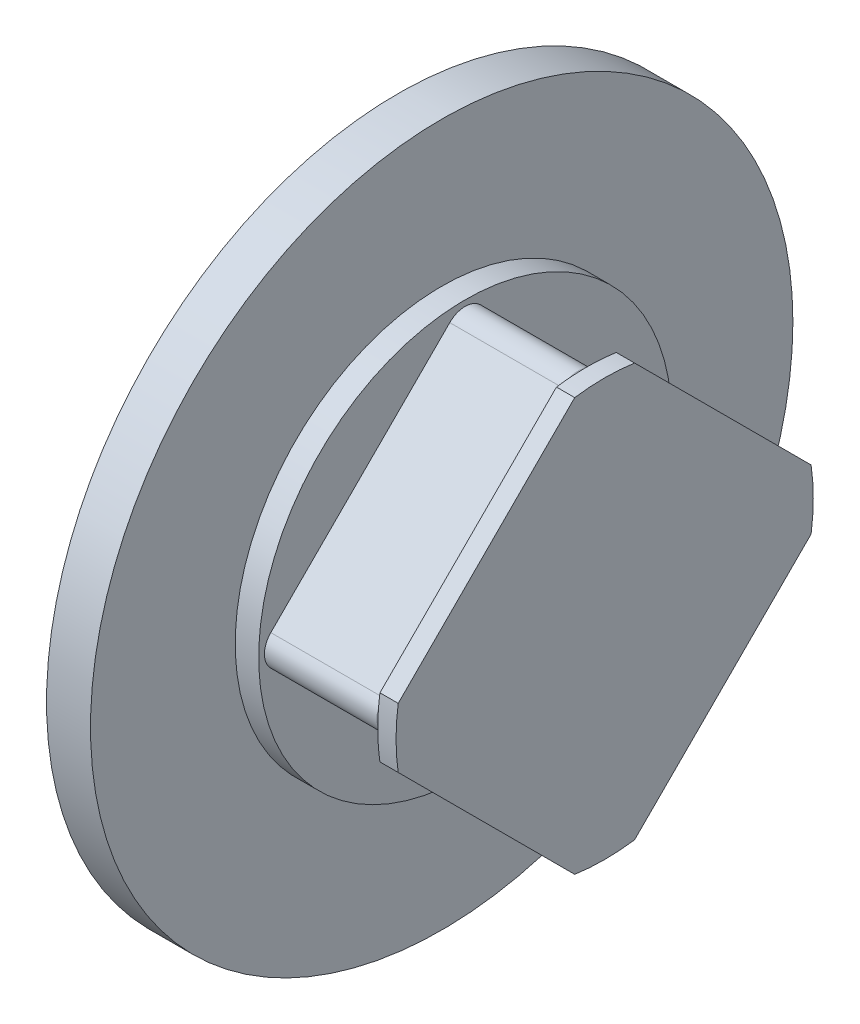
ISO-10303-21;
HEADER;
FILE_DESCRIPTION(('STEP AP214'),'2;1');
FILE_NAME('part.step','',(''),(''),'','','');
FILE_SCHEMA(('AUTOMOTIVE_DESIGN { 1 0 10303 214 1 1 1 1 }'));
ENDSEC;
DATA;
#1=APPLICATION_CONTEXT('core data for automotive mechanical design processes');
#2=APPLICATION_PROTOCOL_DEFINITION('international standard','automotive_design',2000,#1);
#3=PRODUCT_CONTEXT('',#1,'mechanical');
#4=PRODUCT('Part','Part','',(#3));
#5=PRODUCT_RELATED_PRODUCT_CATEGORY('part','',(#4));
#6=PRODUCT_DEFINITION_FORMATION('','',#4);
#7=PRODUCT_DEFINITION_CONTEXT('part definition',#1,'design');
#8=PRODUCT_DEFINITION('design','',#6,#7);
#9=PRODUCT_DEFINITION_SHAPE('','',#8);
#10=(LENGTH_UNIT() NAMED_UNIT(*) SI_UNIT(.MILLI.,.METRE.));
#11=(NAMED_UNIT(*) PLANE_ANGLE_UNIT() SI_UNIT($,.RADIAN.));
#12=(NAMED_UNIT(*) SI_UNIT($,.STERADIAN.) SOLID_ANGLE_UNIT());
#13=UNCERTAINTY_MEASURE_WITH_UNIT(LENGTH_MEASURE(1.E-05),#10,'distance_accuracy_value','');
#14=(GEOMETRIC_REPRESENTATION_CONTEXT(3) GLOBAL_UNCERTAINTY_ASSIGNED_CONTEXT((#13)) GLOBAL_UNIT_ASSIGNED_CONTEXT((#10,
#11,#12)) REPRESENTATION_CONTEXT('',''));
#15=CARTESIAN_POINT('',(0.,0.,0.));
#16=DIRECTION('',(0.,0.,1.));
#17=DIRECTION('',(1.,0.,0.));
#18=AXIS2_PLACEMENT_3D('',#15,#16,#17);
#19=CARTESIAN_POINT('',(34.1122,0.,0.));
#20=DIRECTION('',(1.,0.,0.));
#21=DIRECTION('',(0.,0.,-1.));
#22=AXIS2_PLACEMENT_3D('',#19,#20,#21);
#23=PLANE('',#22);
#24=DIRECTION('',(0.,0.707106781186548,-0.707106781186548));
#25=VECTOR('',#24,1.);
#26=CARTESIAN_POINT('',(34.1122,-3.90641141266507,-36.2660114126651));
#27=LINE('',#26,#25);
#28=CARTESIAN_POINT('',(34.1122,-36.2660114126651,-3.90641141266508));
#29=VERTEX_POINT('',#28);
#30=CARTESIAN_POINT('',(34.1122,-3.90641141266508,-36.2660114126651));
#31=VERTEX_POINT('',#30);
#32=EDGE_CURVE('E406',#29,#31,#27,.T.);
#33=ORIENTED_EDGE('',*,*,#32,.T.);
#34=CARTESIAN_POINT('',(34.1122,0.,-32.3596));
#35=DIRECTION('',(1.,0.,0.));
#36=DIRECTION('',(0.,0.,-1.));
#37=AXIS2_PLACEMENT_3D('',#34,#35,#36);
#38=CIRCLE('',#37,5.5245);
#39=CARTESIAN_POINT('',(34.1122,-1.44698618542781,-37.6912349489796));
#40=VERTEX_POINT('',#39);
#41=EDGE_CURVE('E409',#31,#40,#38,.T.);
#42=ORIENTED_EDGE('',*,*,#41,.T.);
#43=CARTESIAN_POINT('',(34.1122,0.,0.));
#44=DIRECTION('',(1.,0.,0.));
#45=DIRECTION('',(0.,0.,-1.));
#46=AXIS2_PLACEMENT_3D('',#43,#44,#45);
#47=CIRCLE('',#46,37.719);
#48=CARTESIAN_POINT('',(34.1122,-5.41277567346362,-37.3286059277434));
#49=VERTEX_POINT('',#48);
#50=EDGE_CURVE('E723',#49,#40,#47,.T.);
#51=ORIENTED_EDGE('',*,*,#50,.F.);
#52=DIRECTION('',(0.,0.707106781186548,-0.707106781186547));
#53=VECTOR('',#52,1.);
#54=CARTESIAN_POINT('',(34.1122,-5.41277567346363,-37.3286059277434));
#55=LINE('',#54,#53);
#56=CARTESIAN_POINT('',(34.1122,-37.3286059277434,-5.41277567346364));
#57=VERTEX_POINT('',#56);
#58=EDGE_CURVE('E718',#57,#49,#55,.T.);
#59=ORIENTED_EDGE('',*,*,#58,.F.);
#60=CARTESIAN_POINT('',(34.1122,0.,0.));
#61=DIRECTION('',(1.,0.,0.));
#62=DIRECTION('',(0.,0.,-1.));
#63=AXIS2_PLACEMENT_3D('',#60,#61,#62);
#64=CIRCLE('',#63,37.719);
#65=CARTESIAN_POINT('',(34.1122,-37.6912349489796,-1.44698618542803));
#66=VERTEX_POINT('',#65);
#67=EDGE_CURVE('E713',#66,#57,#64,.T.);
#68=ORIENTED_EDGE('',*,*,#67,.F.);
#69=CARTESIAN_POINT('',(34.1122,-32.3596,0.));
#70=DIRECTION('',(1.,0.,0.));
#71=DIRECTION('',(0.,0.,-1.));
#72=AXIS2_PLACEMENT_3D('',#69,#70,#71);
#73=CIRCLE('',#72,5.5245);
#74=EDGE_CURVE('E403',#66,#29,#73,.T.);
#75=ORIENTED_EDGE('',*,*,#74,.T.);
#76=EDGE_LOOP('',(#33,#42,#51,#59,#68,#75));
#77=FACE_BOUND('',#76,.T.);
#78=ADVANCED_FACE('F16',(#77),#23,.F.);
#79=DIRECTION('',(0.,-0.707106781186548,-0.707106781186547));
#80=VECTOR('',#79,1.);
#81=CARTESIAN_POINT('',(34.1122,-36.2660114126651,3.90641141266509));
#82=LINE('',#81,#80);
#83=CARTESIAN_POINT('',(34.1122,-3.90641141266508,36.2660114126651));
#84=VERTEX_POINT('',#83);
#85=CARTESIAN_POINT('',(34.1122,-36.2660114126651,3.90641141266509));
#86=VERTEX_POINT('',#85);
#87=EDGE_CURVE('E397',#84,#86,#82,.T.);
#88=ORIENTED_EDGE('',*,*,#87,.T.);
#89=CARTESIAN_POINT('',(34.1122,-32.3596,0.));
#90=DIRECTION('',(1.,0.,0.));
#91=DIRECTION('',(0.,0.,-1.));
#92=AXIS2_PLACEMENT_3D('',#89,#90,#91);
#93=CIRCLE('',#92,5.5245);
#94=CARTESIAN_POINT('',(34.1122,-37.6912349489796,1.44698618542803));
#95=VERTEX_POINT('',#94);
#96=EDGE_CURVE('E400',#86,#95,#93,.T.);
#97=ORIENTED_EDGE('',*,*,#96,.T.);
#98=CARTESIAN_POINT('',(34.1122,-37.3286059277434,5.41277567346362));
#99=VERTEX_POINT('',#98);
#100=EDGE_CURVE('E714',#99,#95,#64,.T.);
#101=ORIENTED_EDGE('',*,*,#100,.F.);
#102=DIRECTION('',(0.,-0.707106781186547,-0.707106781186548));
#103=VECTOR('',#102,1.);
#104=CARTESIAN_POINT('',(34.1122,-37.3286059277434,5.41277567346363));
#105=LINE('',#104,#103);
#106=CARTESIAN_POINT('',(34.1122,-5.41277567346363,37.3286059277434));
#107=VERTEX_POINT('',#106);
#108=EDGE_CURVE('E710',#107,#99,#105,.T.);
#109=ORIENTED_EDGE('',*,*,#108,.F.);
#110=CARTESIAN_POINT('',(34.1122,0.,0.));
#111=DIRECTION('',(1.,0.,0.));
#112=DIRECTION('',(0.,0.,-1.));
#113=AXIS2_PLACEMENT_3D('',#110,#111,#112);
#114=CIRCLE('',#113,37.719);
#115=CARTESIAN_POINT('',(34.1122,-1.44698618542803,37.6912349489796));
#116=VERTEX_POINT('',#115);
#117=EDGE_CURVE('E701',#116,#107,#114,.T.);
#118=ORIENTED_EDGE('',*,*,#117,.F.);
#119=CARTESIAN_POINT('',(34.1122,0.,32.3596));
#120=DIRECTION('',(1.,0.,0.));
#121=DIRECTION('',(0.,0.,-1.));
#122=AXIS2_PLACEMENT_3D('',#119,#120,#121);
#123=CIRCLE('',#122,5.5245);
#124=EDGE_CURVE('E394',#116,#84,#123,.T.);
#125=ORIENTED_EDGE('',*,*,#124,.T.);
#126=EDGE_LOOP('',(#88,#97,#101,#109,#118,#125));
#127=FACE_BOUND('',#126,.T.);
#128=ADVANCED_FACE('F761',(#127),#23,.F.);
#129=DIRECTION('',(0.,-0.707106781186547,0.707106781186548));
#130=VECTOR('',#129,1.);
#131=CARTESIAN_POINT('',(34.1122,3.90641141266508,36.2660114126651));
#132=LINE('',#131,#130);
#133=CARTESIAN_POINT('',(34.1122,36.2660114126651,3.90641141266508));
#134=VERTEX_POINT('',#133);
#135=CARTESIAN_POINT('',(34.1122,3.90641141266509,36.2660114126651));
#136=VERTEX_POINT('',#135);
#137=EDGE_CURVE('E388',#134,#136,#132,.T.);
#138=ORIENTED_EDGE('',*,*,#137,.T.);
#139=CARTESIAN_POINT('',(34.1122,0.,32.3596));
#140=DIRECTION('',(1.,0.,0.));
#141=DIRECTION('',(0.,0.,-1.));
#142=AXIS2_PLACEMENT_3D('',#139,#140,#141);
#143=CIRCLE('',#142,5.5245);
#144=CARTESIAN_POINT('',(34.1122,1.44698618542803,37.6912349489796));
#145=VERTEX_POINT('',#144);
#146=EDGE_CURVE('E391',#136,#145,#143,.T.);
#147=ORIENTED_EDGE('',*,*,#146,.T.);
#148=CARTESIAN_POINT('',(34.1122,5.41277567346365,37.3286059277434));
#149=VERTEX_POINT('',#148);
#150=EDGE_CURVE('E706',#149,#145,#114,.T.);
#151=ORIENTED_EDGE('',*,*,#150,.F.);
#152=DIRECTION('',(0.,-0.707106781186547,0.707106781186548));
#153=VECTOR('',#152,1.);
#154=CARTESIAN_POINT('',(34.1122,5.41277567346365,37.3286059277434));
#155=LINE('',#154,#153);
#156=CARTESIAN_POINT('',(34.1122,37.3286059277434,5.41277567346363));
#157=VERTEX_POINT('',#156);
#158=EDGE_CURVE('E697',#157,#149,#155,.T.);
#159=ORIENTED_EDGE('',*,*,#158,.F.);
#160=CARTESIAN_POINT('',(34.1122,0.,0.));
#161=DIRECTION('',(1.,0.,0.));
#162=DIRECTION('',(0.,0.,-1.));
#163=AXIS2_PLACEMENT_3D('',#160,#161,#162);
#164=CIRCLE('',#163,37.719);
#165=CARTESIAN_POINT('',(34.1122,37.6912349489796,1.44698618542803));
#166=VERTEX_POINT('',#165);
#167=EDGE_CURVE('E293',#166,#157,#164,.T.);
#168=ORIENTED_EDGE('',*,*,#167,.F.);
#169=CARTESIAN_POINT('',(34.1122,32.3596,0.));
#170=DIRECTION('',(1.,0.,0.));
#171=DIRECTION('',(0.,0.,-1.));
#172=AXIS2_PLACEMENT_3D('',#169,#170,#171);
#173=CIRCLE('',#172,5.5245);
#174=EDGE_CURVE('E385',#166,#134,#173,.T.);
#175=ORIENTED_EDGE('',*,*,#174,.T.);
#176=EDGE_LOOP('',(#138,#147,#151,#159,#168,#175));
#177=FACE_BOUND('',#176,.T.);
#178=ADVANCED_FACE('F807',(#177),#23,.F.);
#179=CARTESIAN_POINT('',(12.192,37.338,0.));
#180=DIRECTION('',(1.,0.,0.));
#181=DIRECTION('',(0.,0.,-1.));
#182=AXIS2_PLACEMENT_3D('',#179,#180,#181);
#183=PLANE('',#182);
#184=CARTESIAN_POINT('',(12.192,0.,0.));
#185=DIRECTION('',(1.,0.,0.));
#186=DIRECTION('',(0.,0.,-1.));
#187=AXIS2_PLACEMENT_3D('',#184,#185,#186);
#188=CIRCLE('',#187,37.338);
#189=CARTESIAN_POINT('',(12.192,0.,-37.338));
#190=VERTEX_POINT('',#189);
#191=EDGE_CURVE('E360',#190,#190,#188,.T.);
#192=ORIENTED_EDGE('',*,*,#191,.T.);
#193=EDGE_LOOP('',(#192));
#194=FACE_BOUND('',#193,.T.);
#195=DIRECTION('',(0.,-0.707106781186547,-0.707106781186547));
#196=VECTOR('',#195,1.);
#197=CARTESIAN_POINT('',(12.192,-35.1434793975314,2.78387939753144));
#198=LINE('',#197,#196);
#199=CARTESIAN_POINT('',(12.192,-2.78387939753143,35.1434793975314));
#200=VERTEX_POINT('',#199);
#201=CARTESIAN_POINT('',(12.192,-35.1434793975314,2.78387939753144));
#202=VERTEX_POINT('',#201);
#203=EDGE_CURVE('E303',#200,#202,#198,.T.);
#204=ORIENTED_EDGE('',*,*,#203,.F.);
#205=CARTESIAN_POINT('',(12.192,0.,32.3596));
#206=DIRECTION('',(1.,0.,0.));
#207=DIRECTION('',(0.,0.,-1.));
#208=AXIS2_PLACEMENT_3D('',#205,#206,#207);
#209=CIRCLE('',#208,3.937);
#210=CARTESIAN_POINT('',(12.192,2.78387939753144,35.1434793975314));
#211=VERTEX_POINT('',#210);
#212=EDGE_CURVE('E296',#211,#200,#209,.T.);
#213=ORIENTED_EDGE('',*,*,#212,.F.);
#214=DIRECTION('',(0.,-0.707106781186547,0.707106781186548));
#215=VECTOR('',#214,1.);
#216=CARTESIAN_POINT('',(12.192,2.78387939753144,35.1434793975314));
#217=LINE('',#216,#215);
#218=CARTESIAN_POINT('',(12.192,35.1434793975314,2.78387939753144));
#219=VERTEX_POINT('',#218);
#220=EDGE_CURVE('E332',#219,#211,#217,.T.);
#221=ORIENTED_EDGE('',*,*,#220,.F.);
#222=CARTESIAN_POINT('',(12.192,32.3596,0.));
#223=DIRECTION('',(1.,0.,0.));
#224=DIRECTION('',(0.,0.,-1.));
#225=AXIS2_PLACEMENT_3D('',#222,#223,#224);
#226=CIRCLE('',#225,3.937);
#227=CARTESIAN_POINT('',(12.192,35.1434793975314,-2.78387939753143));
#228=VERTEX_POINT('',#227);
#229=EDGE_CURVE('E328',#228,#219,#226,.T.);
#230=ORIENTED_EDGE('',*,*,#229,.F.);
#231=DIRECTION('',(0.,0.707106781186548,0.707106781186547));
#232=VECTOR('',#231,1.);
#233=CARTESIAN_POINT('',(12.192,35.1434793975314,-2.78387939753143));
#234=LINE('',#233,#232);
#235=CARTESIAN_POINT('',(12.192,2.78387939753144,-35.1434793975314));
#236=VERTEX_POINT('',#235);
#237=EDGE_CURVE('E324',#236,#228,#234,.T.);
#238=ORIENTED_EDGE('',*,*,#237,.F.);
#239=CARTESIAN_POINT('',(12.192,0.,-32.3596));
#240=DIRECTION('',(1.,0.,0.));
#241=DIRECTION('',(0.,0.,-1.));
#242=AXIS2_PLACEMENT_3D('',#239,#240,#241);
#243=CIRCLE('',#242,3.937);
#244=CARTESIAN_POINT('',(12.192,-2.78387939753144,-35.1434793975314));
#245=VERTEX_POINT('',#244);
#246=EDGE_CURVE('E320',#245,#236,#243,.T.);
#247=ORIENTED_EDGE('',*,*,#246,.F.);
#248=DIRECTION('',(0.,0.707106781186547,-0.707106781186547));
#249=VECTOR('',#248,1.);
#250=CARTESIAN_POINT('',(12.192,-2.78387939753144,-35.1434793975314));
#251=LINE('',#250,#249);
#252=CARTESIAN_POINT('',(12.192,-35.1434793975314,-2.78387939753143));
#253=VERTEX_POINT('',#252);
#254=EDGE_CURVE('E316',#253,#245,#251,.T.);
#255=ORIENTED_EDGE('',*,*,#254,.F.);
#256=CARTESIAN_POINT('',(12.192,-32.3596,0.));
#257=DIRECTION('',(1.,0.,0.));
#258=DIRECTION('',(0.,0.,-1.));
#259=AXIS2_PLACEMENT_3D('',#256,#257,#258);
#260=CIRCLE('',#259,3.937);
#261=EDGE_CURVE('E312',#202,#253,#260,.T.);
#262=ORIENTED_EDGE('',*,*,#261,.F.);
#263=EDGE_LOOP('',(#204,#213,#221,#230,#238,#247,#255,#262));
#264=FACE_BOUND('',#263,.T.);
#265=ADVANCED_FACE('F575',(#194,#264),#183,.T.);
#266=CARTESIAN_POINT('',(0.,0.,0.));
#267=DIRECTION('',(-1.,0.,0.));
#268=DIRECTION('',(0.,0.,1.));
#269=AXIS2_PLACEMENT_3D('',#266,#267,#268);
#270=PLANE('',#269);
#271=CARTESIAN_POINT('',(0.,0.,0.));
#272=DIRECTION('',(1.,0.,0.));
#273=DIRECTION('',(0.,0.,-1.));
#274=AXIS2_PLACEMENT_3D('',#271,#272,#273);
#275=CIRCLE('',#274,63.5);
#276=CARTESIAN_POINT('',(0.,0.,-63.5));
#277=VERTEX_POINT('',#276);
#278=EDGE_CURVE('E372',#277,#277,#275,.T.);
#279=ORIENTED_EDGE('',*,*,#278,.F.);
#280=EDGE_LOOP('',(#279));
#281=FACE_BOUND('',#280,.T.);
#282=ADVANCED_FACE('F435',(#281),#270,.T.);
#283=CARTESIAN_POINT('',(0.,0.,0.));
#284=DIRECTION('',(1.,0.,0.));
#285=DIRECTION('',(0.,0.,-1.));
#286=AXIS2_PLACEMENT_3D('',#283,#284,#285);
#287=CYLINDRICAL_SURFACE('',#286,63.5);
#288=ORIENTED_EDGE('',*,*,#278,.T.);
#289=EDGE_LOOP('',(#288));
#290=FACE_BOUND('',#289,.T.);
#291=CARTESIAN_POINT('',(7.9502,0.,0.));
#292=DIRECTION('',(1.,0.,0.));
#293=DIRECTION('',(0.,0.,-1.));
#294=AXIS2_PLACEMENT_3D('',#291,#292,#293);
#295=CIRCLE('',#294,63.5);
#296=CARTESIAN_POINT('',(7.9502,0.,-63.5));
#297=VERTEX_POINT('',#296);
#298=EDGE_CURVE('E368',#297,#297,#295,.T.);
#299=ORIENTED_EDGE('',*,*,#298,.F.);
#300=EDGE_LOOP('',(#299));
#301=FACE_BOUND('',#300,.T.);
#302=ADVANCED_FACE('F909',(#290,#301),#287,.T.);
#303=CARTESIAN_POINT('',(7.9502,63.5,0.));
#304=DIRECTION('',(1.,0.,0.));
#305=DIRECTION('',(0.,0.,-1.));
#306=AXIS2_PLACEMENT_3D('',#303,#304,#305);
#307=PLANE('',#306);
#308=ORIENTED_EDGE('',*,*,#298,.T.);
#309=EDGE_LOOP('',(#308));
#310=FACE_BOUND('',#309,.T.);
#311=CARTESIAN_POINT('',(7.9502,0.,0.));
#312=DIRECTION('',(1.,0.,0.));
#313=DIRECTION('',(0.,0.,-1.));
#314=AXIS2_PLACEMENT_3D('',#311,#312,#313);
#315=CIRCLE('',#314,37.338);
#316=CARTESIAN_POINT('',(7.9502,0.,-37.338));
#317=VERTEX_POINT('',#316);
#318=EDGE_CURVE('E364',#317,#317,#315,.T.);
#319=ORIENTED_EDGE('',*,*,#318,.F.);
#320=EDGE_LOOP('',(#319));
#321=FACE_BOUND('',#320,.T.);
#322=ADVANCED_FACE('F914',(#310,#321),#307,.T.);
#323=CARTESIAN_POINT('',(0.,0.,0.));
#324=DIRECTION('',(1.,0.,0.));
#325=DIRECTION('',(0.,0.,-1.));
#326=AXIS2_PLACEMENT_3D('',#323,#324,#325);
#327=CYLINDRICAL_SURFACE('',#326,37.338);
#328=ORIENTED_EDGE('',*,*,#318,.T.);
#329=EDGE_LOOP('',(#328));
#330=FACE_BOUND('',#329,.T.);
#331=ORIENTED_EDGE('',*,*,#191,.F.);
#332=EDGE_LOOP('',(#331));
#333=FACE_BOUND('',#332,.T.);
#334=ADVANCED_FACE('F573',(#330,#333),#327,.T.);
#335=CARTESIAN_POINT('',(34.1122,0.,32.3596));
#336=DIRECTION('',(-1.,0.,0.));
#337=DIRECTION('',(0.,0.,1.));
#338=AXIS2_PLACEMENT_3D('',#335,#336,#337);
#339=CYLINDRICAL_SURFACE('',#338,3.937);
#340=DIRECTION('',(-1.,0.,0.));
#341=VECTOR('',#340,1.);
#342=CARTESIAN_POINT('',(34.1122,-2.78387939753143,35.1434793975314));
#343=LINE('',#342,#341);
#344=CARTESIAN_POINT('',(32.5247,-2.78387939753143,35.1434793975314));
#345=VERTEX_POINT('',#344);
#346=EDGE_CURVE('E357',#345,#200,#343,.T.);
#347=ORIENTED_EDGE('',*,*,#346,.F.);
#348=CARTESIAN_POINT('',(32.5247,0.,32.3596));
#349=DIRECTION('',(1.,0.,0.));
#350=DIRECTION('',(0.,0.,-1.));
#351=AXIS2_PLACEMENT_3D('',#348,#349,#350);
#352=CIRCLE('',#351,3.937);
#353=CARTESIAN_POINT('',(32.5247,-1.03118555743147,36.1591559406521));
#354=VERTEX_POINT('',#353);
#355=EDGE_CURVE('E586',#345,#354,#352,.F.);
#356=ORIENTED_EDGE('',*,*,#355,.T.);
#357=CARTESIAN_POINT('',(34.1122,2.23548255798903,37.6526968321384));
#358=CARTESIAN_POINT('',(34.3657339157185,1.49627214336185,36.0024209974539));
#359=CARTESIAN_POINT('',(32.5422439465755,1.58316184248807,35.9642591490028));
#360=CARTESIAN_POINT('',(34.1122,2.09419516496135,37.6610908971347));
#361=CARTESIAN_POINT('',(34.3052543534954,1.42632973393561,36.0307133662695));
#362=CARTESIAN_POINT('',(32.5345545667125,1.48530627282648,36.0072533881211));
#363=CARTESIAN_POINT('',(34.1122,1.95123478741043,37.6687751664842));
#364=CARTESIAN_POINT('',(34.2527927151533,1.34596202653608,36.0608498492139));
#365=CARTESIAN_POINT('',(32.5300150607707,1.38563244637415,36.0462607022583));
#366=CARTESIAN_POINT('',(34.1122,1.66275076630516,37.6826080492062));
#367=CARTESIAN_POINT('',(34.1638217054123,1.17252087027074,36.1189356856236));
#368=CARTESIAN_POINT('',(32.5249584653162,1.18343159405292,36.1160425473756));
#369=CARTESIAN_POINT('',(34.1122,1.5172282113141,37.6887572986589));
#370=CARTESIAN_POINT('',(34.1266199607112,1.07925093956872,36.1471204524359));
#371=CARTESIAN_POINT('',(32.524439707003,1.08090576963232,36.1468204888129));
#372=CARTESIAN_POINT('',(34.1122,1.22446135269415,37.6994047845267));
#373=CARTESIAN_POINT('',(34.0653324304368,0.884356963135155,36.1973118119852));
#374=CARTESIAN_POINT('',(32.5251442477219,0.8738271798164,36.1998886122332));
#375=CARTESIAN_POINT('',(34.1122,1.07721934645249,37.7039050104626));
#376=CARTESIAN_POINT('',(34.0407940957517,0.782311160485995,36.2195962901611));
#377=CARTESIAN_POINT('',(32.5263654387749,0.769277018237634,36.2221890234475));
#378=CARTESIAN_POINT('',(34.1122,0.781432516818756,37.7111946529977));
#379=CARTESIAN_POINT('',(34.0023924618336,0.573152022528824,36.2561042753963));
#380=CARTESIAN_POINT('',(32.5290214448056,0.558701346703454,36.2582189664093));
#381=CARTESIAN_POINT('',(34.1122,0.632887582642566,37.7139839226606));
#382=CARTESIAN_POINT('',(33.9882769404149,0.465466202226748,36.2705411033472));
#383=CARTESIAN_POINT('',(32.5304562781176,0.452675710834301,36.2719477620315));
#384=CARTESIAN_POINT('',(34.1122,0.33301273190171,37.7178322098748));
#385=CARTESIAN_POINT('',(33.9691342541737,0.246382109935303,36.2904416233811));
#386=CARTESIAN_POINT('',(32.5325642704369,0.238347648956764,36.2908716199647));
#387=CARTESIAN_POINT('',(34.1122,0.181673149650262,37.7188661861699));
#388=CARTESIAN_POINT('',(33.9641149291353,0.134271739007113,36.2959007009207));
#389=CARTESIAN_POINT('',(32.5332263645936,0.130034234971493,36.2959431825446));
#390=CARTESIAN_POINT('',(34.1122,-0.121041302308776,37.7191094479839));
#391=CARTESIAN_POINT('',(33.9629315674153,-0.089419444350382,36.2971716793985));
#392=CARTESIAN_POINT('',(32.5333757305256,-0.0866362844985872,36.2971372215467));
#393=CARTESIAN_POINT('',(34.1122,-0.272416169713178,37.7183188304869));
#394=CARTESIAN_POINT('',(33.9667596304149,-0.201703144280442,36.2929921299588));
#395=CARTESIAN_POINT('',(32.532863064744,-0.194993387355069,36.2932601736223));
#396=CARTESIAN_POINT('',(34.1122,-0.574481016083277,37.7149272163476));
#397=CARTESIAN_POINT('',(33.9835436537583,-0.422995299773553,36.2754089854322));
#398=CARTESIAN_POINT('',(32.5309521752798,-0.410960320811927,36.276589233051));
#399=CARTESIAN_POINT('',(34.1122,-0.725171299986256,37.712327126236));
#400=CARTESIAN_POINT('',(33.9966021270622,-0.532686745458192,36.2618998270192));
#401=CARTESIAN_POINT('',(32.5295543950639,-0.5185704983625,36.263799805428));
#402=CARTESIAN_POINT('',(34.1122,-1.02530407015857,37.7053609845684));
#403=CARTESIAN_POINT('',(34.0329838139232,-0.746042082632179,36.2268207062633));
#404=CARTESIAN_POINT('',(32.5268140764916,-0.732371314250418,36.2293966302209));
#405=CARTESIAN_POINT('',(34.1122,-1.17474654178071,37.7009949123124));
#406=CARTESIAN_POINT('',(34.0565516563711,-0.850314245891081,36.2050377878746));
#407=CARTESIAN_POINT('',(32.525471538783,-0.838561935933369,36.2077827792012));
#408=CARTESIAN_POINT('',(34.1122,-1.47518167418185,37.6904484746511));
#409=CARTESIAN_POINT('',(34.1166003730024,-1.05200801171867,36.1549200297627));
#410=CARTESIAN_POINT('',(32.5243849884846,-1.05124059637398,36.1552728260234));
#411=CARTESIAN_POINT('',(34.1122,-1.62613044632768,37.6842285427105));
#412=CARTESIAN_POINT('',(34.1538101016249,-1.14966978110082,36.1261626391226));
#413=CARTESIAN_POINT('',(32.524678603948,-1.15767888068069,36.1241739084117));
#414=CARTESIAN_POINT('',(34.1122,-1.9252029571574,37.670133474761));
#415=CARTESIAN_POINT('',(34.2437489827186,-1.33112452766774,36.0661907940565));
#416=CARTESIAN_POINT('',(32.5292716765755,-1.36745577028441,36.0531472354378));
#417=CARTESIAN_POINT('',(34.1122,-2.07332841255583,37.6622593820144));
#418=CARTESIAN_POINT('',(34.2972133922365,-1.41517618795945,36.034699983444));
#419=CARTESIAN_POINT('',(32.5335686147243,-1.4707962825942,36.0132250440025));
#420=CARTESIAN_POINT('',(34.1122,-2.36648369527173,37.6449774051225));
#421=CARTESIAN_POINT('',(34.4230294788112,-1.56423028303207,35.975383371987));
#422=CARTESIAN_POINT('',(32.549226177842,-1.67394455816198,35.9247339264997));
#423=CARTESIAN_POINT('',(34.1122,-2.51150035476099,37.6355640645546));
#424=CARTESIAN_POINT('',(34.4965778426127,-1.62897152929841,35.9475028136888));
#425=CARTESIAN_POINT('',(32.5606123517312,-1.77373815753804,35.8761341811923));
#426=CARTESIAN_POINT('',(34.1122,-2.72529255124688,37.6204847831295));
#427=CARTESIAN_POINT('',(34.6210899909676,-1.70480186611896,35.9169029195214));
#428=CARTESIAN_POINT('',(32.5859936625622,-1.91964729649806,35.7973309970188));
#429=CARTESIAN_POINT('',(34.1122,-2.79602747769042,37.6152908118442));
#430=CARTESIAN_POINT('',(34.6660002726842,-1.72680264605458,35.9084957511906));
#431=CARTESIAN_POINT('',(32.5958567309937,-1.96771581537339,35.7700384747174));
#432=CARTESIAN_POINT('',(34.1122,-2.93598067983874,37.6046262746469));
#433=CARTESIAN_POINT('',(34.7609822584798,-1.7625743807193,35.8974591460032));
#434=CARTESIAN_POINT('',(32.6189947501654,-2.06238906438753,35.713637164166));
#435=CARTESIAN_POINT('',(34.1122,-3.00519786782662,37.5991555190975));
#436=CARTESIAN_POINT('',(34.8112639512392,-1.77615867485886,35.894971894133));
#437=CARTESIAN_POINT('',(32.6322720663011,-2.1089927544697,35.684527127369));
#438=CARTESIAN_POINT('',(34.1122,-3.07350633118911,37.5935701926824));
#439=CARTESIAN_POINT('',(34.8632761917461,-1.78468723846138,35.896601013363));
#440=CARTESIAN_POINT('',(32.6475689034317,-2.15475426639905,35.6545966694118));
#441=(BOUNDED_SURFACE() B_SPLINE_SURFACE(3,2,((#357,#358,#359),(#360,#361,#362),(#363,#364,
#365),(#366,#367,#368),(#369,#370,#371),(#372,#373,#374),(#375,#376,#377),(#378,#379,#380),
(#381,#382,#383),(#384,#385,#386),(#387,#388,#389),(#390,#391,#392),(#393,#394,#395),(#396,#397,
#398),(#399,#400,#401),(#402,#403,#404),(#405,#406,#407),(#408,#409,#410),(#411,#412,#413),
(#414,#415,#416),(#417,#418,#419),(#420,#421,#422),(#423,#424,#425),(#426,#427,#428),(#429,#430,
#431),(#432,#433,#434),(#435,#436,#437),(#438,#439,#440)),.UNSPECIFIED.,.F.,.F.,
.F.) B_SPLINE_SURFACE_WITH_KNOTS((4,2,2,2,2,2,2,2,2,2,2,2,2,4),(3,3),(0.,0.450276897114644,
0.900366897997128,1.34991207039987,1.79949584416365,2.25544115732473,2.71136223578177,
3.16705506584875,3.62275323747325,4.08897412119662,4.55490184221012,5.02251851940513,
5.25696094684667,5.49156623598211),(0.,1.),
.UNSPECIFIED.) GEOMETRIC_REPRESENTATION_ITEM() RATIONAL_B_SPLINE_SURFACE(((1.,0.656110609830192,
1.),(1.,0.667375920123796,1.),(1.,0.677587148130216,1.),(1.,0.695841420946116,1.),(1.,
0.703885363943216,1.),(1.,0.71774609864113,1.),(1.,0.723565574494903,1.),(1.,0.732963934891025,
1.),(1.,0.736542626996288,1.),(1.,0.741474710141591,1.),(1.,0.742795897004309,1.),(1.,
0.743106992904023,1.),(1.,0.742097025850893,1.),(1.,0.737752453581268,1.),(1.,0.734419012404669,
1.),(1.,0.725446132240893,1.),(1.,0.719806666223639,1.),(1.,0.706093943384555,1.),(1.,
0.697967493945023,1.),(1.,0.67938944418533,1.),(1.,0.668939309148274,1.),(1.,0.645755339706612,
1.),(1.,0.633013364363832,1.),(1.,0.612343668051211,1.),(1.,0.605183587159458,1.),(1.,
0.590387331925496,1.),(1.,0.582750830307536,1.),(1.,0.574900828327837,1.))) REPRESENTATION_ITEM('') SURFACE());
#442=CARTESIAN_POINT('',(32.6475689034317,-2.15475426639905,35.6545966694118));
#443=CARTESIAN_POINT('',(32.6322720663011,-2.1089927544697,35.684527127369));
#444=CARTESIAN_POINT('',(32.6189947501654,-2.06238906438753,35.713637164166));
#445=CARTESIAN_POINT('',(32.5958567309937,-1.96771581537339,35.7700384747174));
#446=CARTESIAN_POINT('',(32.5859936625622,-1.91964729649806,35.7973309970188));
#447=CARTESIAN_POINT('',(32.5606123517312,-1.77373815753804,35.8761341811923));
#448=CARTESIAN_POINT('',(32.549226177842,-1.67394455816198,35.9247339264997));
#449=CARTESIAN_POINT('',(32.5335686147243,-1.4707962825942,36.0132250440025));
#450=CARTESIAN_POINT('',(32.5292716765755,-1.36745577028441,36.0531472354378));
#451=CARTESIAN_POINT('',(32.524678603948,-1.15767888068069,36.1241739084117));
#452=CARTESIAN_POINT('',(32.5243849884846,-1.05124059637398,36.1552728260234));
#453=CARTESIAN_POINT('',(32.525471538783,-0.838561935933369,36.2077827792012));
#454=CARTESIAN_POINT('',(32.5268140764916,-0.732371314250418,36.2293966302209));
#455=CARTESIAN_POINT('',(32.5295543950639,-0.5185704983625,36.263799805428));
#456=CARTESIAN_POINT('',(32.5309521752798,-0.410960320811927,36.276589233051));
#457=CARTESIAN_POINT('',(32.532863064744,-0.194993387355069,36.2932601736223));
#458=CARTESIAN_POINT('',(32.5333757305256,-0.0866362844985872,36.2971372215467));
#459=CARTESIAN_POINT('',(32.5332263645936,0.130034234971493,36.2959431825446));
#460=CARTESIAN_POINT('',(32.5325642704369,0.238347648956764,36.2908716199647));
#461=CARTESIAN_POINT('',(32.5304562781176,0.452675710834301,36.2719477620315));
#462=CARTESIAN_POINT('',(32.5290214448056,0.558701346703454,36.2582189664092));
#463=CARTESIAN_POINT('',(32.5263654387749,0.769277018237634,36.2221890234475));
#464=CARTESIAN_POINT('',(32.5251442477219,0.8738271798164,36.1998886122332));
#465=CARTESIAN_POINT('',(32.524439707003,1.08090576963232,36.1468204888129));
#466=CARTESIAN_POINT('',(32.5249584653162,1.18343159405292,36.1160425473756));
#467=CARTESIAN_POINT('',(32.5300150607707,1.38563244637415,36.0462607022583));
#468=CARTESIAN_POINT('',(32.5345545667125,1.48530627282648,36.0072533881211));
#469=CARTESIAN_POINT('',(32.5422439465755,1.58316184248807,35.9642591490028));
#470=B_SPLINE_CURVE_WITH_KNOTS('',3,(#442,#443,#444,#445,#446,#447,#448,#449,#450,#451,#452,
#453,#454,#455,#456,#457,#458,#459,#460,#461,#462,#463,#464,#465,#466,#467,#468,#469),
.UNSPECIFIED.,.F.,.F.,(4,2,2,2,2,2,2,2,2,2,2,2,2,4),(0.,0.234605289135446,0.469047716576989,
0.936664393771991,1.40259211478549,1.86881299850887,2.32451117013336,2.78020400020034,
3.23612507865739,3.69207039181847,4.14165416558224,4.59119933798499,5.04128933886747,
5.49156623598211),.UNSPECIFIED.);
#471=CARTESIAN_POINT('',(32.5247,1.03118555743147,36.1591559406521));
#472=VERTEX_POINT('',#471);
#473=EDGE_CURVE('E579',#354,#472,#470,.T.);
#474=ORIENTED_EDGE('',*,*,#473,.T.);
#475=CARTESIAN_POINT('',(32.5247,0.,32.3596));
#476=DIRECTION('',(1.,0.,0.));
#477=DIRECTION('',(0.,0.,-1.));
#478=AXIS2_PLACEMENT_3D('',#475,#476,#477);
#479=CIRCLE('',#478,3.937);
#480=CARTESIAN_POINT('',(32.5247,2.78387939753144,35.1434793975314));
#481=VERTEX_POINT('',#480);
#482=EDGE_CURVE('E587',#472,#481,#479,.F.);
#483=ORIENTED_EDGE('',*,*,#482,.T.);
#484=DIRECTION('',(-1.,0.,0.));
#485=VECTOR('',#484,1.);
#486=CARTESIAN_POINT('',(34.1122,2.78387939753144,35.1434793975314));
#487=LINE('',#486,#485);
#488=EDGE_CURVE('E336',#481,#211,#487,.T.);
#489=ORIENTED_EDGE('',*,*,#488,.T.);
#490=ORIENTED_EDGE('',*,*,#212,.T.);
#491=EDGE_LOOP('',(#347,#356,#474,#483,#489,#490));
#492=FACE_BOUND('',#491,.T.);
#493=ADVANCED_FACE('F568',(#492),#339,.T.);
#494=CARTESIAN_POINT('',(34.1122,-35.1434793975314,2.78387939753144));
#495=DIRECTION('',(0.,0.707106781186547,-0.707106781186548));
#496=DIRECTION('',(0.,0.707106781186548,0.707106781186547));
#497=AXIS2_PLACEMENT_3D('',#494,#495,#496);
#498=PLANE('',#497);
#499=DIRECTION('',(-1.,0.,0.));
#500=VECTOR('',#499,1.);
#501=CARTESIAN_POINT('',(34.1122,-35.1434793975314,2.78387939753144));
#502=LINE('',#501,#500);
#503=CARTESIAN_POINT('',(32.5247,-35.1434793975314,2.78387939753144));
#504=VERTEX_POINT('',#503);
#505=EDGE_CURVE('E354',#504,#202,#502,.T.);
#506=ORIENTED_EDGE('',*,*,#505,.F.);
#507=DIRECTION('',(0.,-0.707106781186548,-0.707106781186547));
#508=VECTOR('',#507,1.);
#509=CARTESIAN_POINT('',(32.5247,-2.78387939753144,35.1434793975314));
#510=LINE('',#509,#508);
#511=EDGE_CURVE('E826',#504,#345,#510,.F.);
#512=ORIENTED_EDGE('',*,*,#511,.T.);
#513=ORIENTED_EDGE('',*,*,#346,.T.);
#514=ORIENTED_EDGE('',*,*,#203,.T.);
#515=EDGE_LOOP('',(#506,#512,#513,#514));
#516=FACE_BOUND('',#515,.T.);
#517=ADVANCED_FACE('F572',(#516),#498,.F.);
#518=CARTESIAN_POINT('',(34.1122,-32.3596,0.));
#519=DIRECTION('',(-1.,0.,0.));
#520=DIRECTION('',(0.,0.,1.));
#521=AXIS2_PLACEMENT_3D('',#518,#519,#520);
#522=CYLINDRICAL_SURFACE('',#521,3.937);
#523=DIRECTION('',(-1.,0.,0.));
#524=VECTOR('',#523,1.);
#525=CARTESIAN_POINT('',(34.1122,-35.1434793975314,-2.78387939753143));
#526=LINE('',#525,#524);
#527=CARTESIAN_POINT('',(32.5247,-35.1434793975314,-2.78387939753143));
#528=VERTEX_POINT('',#527);
#529=EDGE_CURVE('E351',#528,#253,#526,.T.);
#530=ORIENTED_EDGE('',*,*,#529,.F.);
#531=CARTESIAN_POINT('',(32.5247,-32.3596,0.));
#532=DIRECTION('',(1.,0.,0.));
#533=DIRECTION('',(0.,0.,-1.));
#534=AXIS2_PLACEMENT_3D('',#531,#532,#533);
#535=CIRCLE('',#534,3.937);
#536=CARTESIAN_POINT('',(32.5247,-36.1591559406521,-1.03118555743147));
#537=VERTEX_POINT('',#536);
#538=EDGE_CURVE('E830',#528,#537,#535,.F.);
#539=ORIENTED_EDGE('',*,*,#538,.T.);
#540=CARTESIAN_POINT('',(34.1122,-37.6526968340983,2.23548252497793));
#541=CARTESIAN_POINT('',(34.3657339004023,-36.0024210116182,1.49627211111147));
#542=CARTESIAN_POINT('',(32.5422439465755,-35.9642591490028,1.58316184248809));
#543=CARTESIAN_POINT('',(34.1122,-37.6610908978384,2.09419515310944));
#544=CARTESIAN_POINT('',(34.3052543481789,-36.0307133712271,1.42632972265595));
#545=CARTESIAN_POINT('',(32.5345545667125,-36.0072533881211,1.48530627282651));
#546=CARTESIAN_POINT('',(34.1122,-37.6687751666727,1.95123478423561));
#547=CARTESIAN_POINT('',(34.2527927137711,-36.0608498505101,1.34596202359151));
#548=CARTESIAN_POINT('',(32.5300150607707,-36.0462607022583,1.38563244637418));
#549=CARTESIAN_POINT('',(34.1122,-37.6826080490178,1.66275076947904));
#550=CARTESIAN_POINT('',(34.1638217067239,-36.1189356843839,1.17252087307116));
#551=CARTESIAN_POINT('',(32.5249584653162,-36.1160425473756,1.18343159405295));
#552=CARTESIAN_POINT('',(34.1122,-37.6887572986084,1.51722821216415));
#553=CARTESIAN_POINT('',(34.1266199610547,-36.1471204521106,1.07925094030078));
#554=CARTESIAN_POINT('',(32.524439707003,-36.1468204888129,1.08090576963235));
#555=CARTESIAN_POINT('',(34.1122,-37.6994047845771,1.22446135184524));
#556=CARTESIAN_POINT('',(34.0653324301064,-36.1973118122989,0.884356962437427));
#557=CARTESIAN_POINT('',(32.5251442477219,-36.1998886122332,0.873827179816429));
#558=CARTESIAN_POINT('',(34.1122,-37.7039050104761,1.07721934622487));
#559=CARTESIAN_POINT('',(34.0407940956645,-36.2195962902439,0.782311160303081));
#560=CARTESIAN_POINT('',(32.5263654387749,-36.2221890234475,0.769277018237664));
#561=CARTESIAN_POINT('',(34.1122,-37.7111946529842,0.781432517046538));
#562=CARTESIAN_POINT('',(34.0023924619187,-36.2561042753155,0.573152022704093));
#563=CARTESIAN_POINT('',(32.5290214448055,-36.2582189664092,0.558701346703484));
#564=CARTESIAN_POINT('',(34.1122,-37.7139839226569,0.632887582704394));
#565=CARTESIAN_POINT('',(33.9882769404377,-36.2705411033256,0.465466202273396));
#566=CARTESIAN_POINT('',(32.5304562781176,-36.2719477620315,0.452675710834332));
#567=CARTESIAN_POINT('',(34.1122,-37.7178322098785,0.333012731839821));
#568=CARTESIAN_POINT('',(33.969134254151,-36.2904416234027,0.246382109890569));
#569=CARTESIAN_POINT('',(32.5325642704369,-36.2908716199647,0.238347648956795));
#570=CARTESIAN_POINT('',(34.1122,-37.7188661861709,0.181673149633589));
#571=CARTESIAN_POINT('',(33.9641149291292,-36.2959007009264,0.134271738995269));
#572=CARTESIAN_POINT('',(32.5332263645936,-36.2959431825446,0.130034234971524));
#573=CARTESIAN_POINT('',(34.1122,-37.7191094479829,-0.1210413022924));
#574=CARTESIAN_POINT('',(33.9629315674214,-36.2971716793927,-0.0894194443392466));
#575=CARTESIAN_POINT('',(32.5333757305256,-36.2971372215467,-0.0866362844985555));
#576=CARTESIAN_POINT('',(34.1122,-37.7183188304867,-0.272416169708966));
#577=CARTESIAN_POINT('',(33.9667596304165,-36.2929921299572,-0.201703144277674));
#578=CARTESIAN_POINT('',(32.532863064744,-36.2932601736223,-0.194993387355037));
#579=CARTESIAN_POINT('',(34.1122,-37.7149272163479,-0.574481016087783));
#580=CARTESIAN_POINT('',(33.9835436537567,-36.2754089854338,-0.422995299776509));
#581=CARTESIAN_POINT('',(32.5309521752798,-36.276589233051,-0.410960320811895));
#582=CARTESIAN_POINT('',(34.1122,-37.7123271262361,-0.725171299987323));
#583=CARTESIAN_POINT('',(33.9966021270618,-36.2618998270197,-0.532686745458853));
#584=CARTESIAN_POINT('',(32.5295543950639,-36.263799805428,-0.518570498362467));
#585=CARTESIAN_POINT('',(34.1122,-37.7053609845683,-1.02530407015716));
#586=CARTESIAN_POINT('',(34.0329838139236,-36.2268207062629,-0.746042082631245));
#587=CARTESIAN_POINT('',(32.5268140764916,-36.2293966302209,-0.732371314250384));
#588=CARTESIAN_POINT('',(34.1122,-37.7009949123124,-1.17474654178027));
#589=CARTESIAN_POINT('',(34.0565516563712,-36.2050377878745,-0.85031424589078));
#590=CARTESIAN_POINT('',(32.525471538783,-36.2077827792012,-0.838561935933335));
#591=CARTESIAN_POINT('',(34.1122,-37.6904484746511,-1.47518167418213));
#592=CARTESIAN_POINT('',(34.1166003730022,-36.1549200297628,-1.05200801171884));
#593=CARTESIAN_POINT('',(32.5243849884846,-36.1552728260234,-1.05124059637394));
#594=CARTESIAN_POINT('',(34.1122,-37.6842285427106,-1.62613044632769));
#595=CARTESIAN_POINT('',(34.1538101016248,-36.1261626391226,-1.14966978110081));
#596=CARTESIAN_POINT('',(32.524678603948,-36.1241739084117,-1.15767888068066));
#597=CARTESIAN_POINT('',(34.1122,-37.670133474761,-1.92520295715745));
#598=CARTESIAN_POINT('',(34.2437489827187,-36.0661907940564,-1.33112452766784));
#599=CARTESIAN_POINT('',(32.5292716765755,-36.0531472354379,-1.36745577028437));
#600=CARTESIAN_POINT('',(34.1122,-37.6622593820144,-2.0733284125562));
#601=CARTESIAN_POINT('',(34.2972133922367,-36.0346999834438,-1.41517618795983));
#602=CARTESIAN_POINT('',(32.5335686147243,-36.0132250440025,-1.47079628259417));
#603=CARTESIAN_POINT('',(34.1122,-37.6449774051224,-2.36648369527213));
#604=CARTESIAN_POINT('',(34.4230294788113,-35.9753833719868,-1.56423028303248));
#605=CARTESIAN_POINT('',(32.549226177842,-35.9247339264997,-1.67394455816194));
#606=CARTESIAN_POINT('',(34.1122,-37.6355640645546,-2.51150035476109));
#607=CARTESIAN_POINT('',(34.4965778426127,-35.9475028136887,-1.62897152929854));
#608=CARTESIAN_POINT('',(32.5606123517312,-35.8761341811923,-1.773738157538));
#609=CARTESIAN_POINT('',(34.1122,-37.6204847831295,-2.72529255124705));
#610=CARTESIAN_POINT('',(34.6210899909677,-35.9169029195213,-1.70480186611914));
#611=CARTESIAN_POINT('',(32.5859936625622,-35.7973309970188,-1.91964729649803));
#612=CARTESIAN_POINT('',(34.1122,-37.6152908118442,-2.7960274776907));
#613=CARTESIAN_POINT('',(34.6660002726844,-35.9084957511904,-1.72680264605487));
#614=CARTESIAN_POINT('',(32.5958567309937,-35.7700384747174,-1.96771581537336));
#615=CARTESIAN_POINT('',(34.1122,-37.6046262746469,-2.93598067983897));
#616=CARTESIAN_POINT('',(34.76098225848,-35.8974591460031,-1.76257438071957));
#617=CARTESIAN_POINT('',(32.6189947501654,-35.713637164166,-2.0623890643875));
#618=CARTESIAN_POINT('',(34.1122,-37.5991555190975,-3.00519786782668));
#619=CARTESIAN_POINT('',(34.8112639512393,-35.894971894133,-1.77615867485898));
#620=CARTESIAN_POINT('',(32.632272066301,-35.6845271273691,-2.10899275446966));
#621=CARTESIAN_POINT('',(34.1122,-37.5935701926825,-3.07350633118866));
#622=CARTESIAN_POINT('',(34.8632761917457,-35.8966010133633,-1.78468723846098));
#623=CARTESIAN_POINT('',(32.6475689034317,-35.6545966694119,-2.15475426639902));
#624=(BOUNDED_SURFACE() B_SPLINE_SURFACE(3,2,((#540,#541,#542),(#543,#544,#545),(#546,#547,
#548),(#549,#550,#551),(#552,#553,#554),(#555,#556,#557),(#558,#559,#560),(#561,#562,#563),
(#564,#565,#566),(#567,#568,#569),(#570,#571,#572),(#573,#574,#575),(#576,#577,#578),(#579,#580,
#581),(#582,#583,#584),(#585,#586,#587),(#588,#589,#590),(#591,#592,#593),(#594,#595,#596),
(#597,#598,#599),(#600,#601,#602),(#603,#604,#605),(#606,#607,#608),(#609,#610,#611),(#612,#613,
#614),(#615,#616,#617),(#618,#619,#620),(#621,#622,#623)),.UNSPECIFIED.,.F.,.F.,
.F.) B_SPLINE_SURFACE_WITH_KNOTS((4,2,2,2,2,2,2,2,2,2,2,2,2,4),(3,3),(0.,0.450276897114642,
0.900366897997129,1.34991207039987,1.79949584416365,2.25544115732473,2.71136223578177,
3.16705506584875,3.62275323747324,4.08897412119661,4.55490184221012,5.02251851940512,
5.25696094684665,5.49156623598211),(0.,1.),
.UNSPECIFIED.) GEOMETRIC_REPRESENTATION_ITEM() RATIONAL_B_SPLINE_SURFACE(((1.,0.656110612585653,
1.),(1.,0.667375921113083,1.),(1.,0.677587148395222,1.),(1.,0.695841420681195,1.),(1.,
0.703885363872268,1.),(1.,0.717746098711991,1.),(1.,0.723565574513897,1.),(1.,0.732963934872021,
1.),(1.,0.736542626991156,1.),(1.,0.741474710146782,1.),(1.,0.742795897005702,1.),(1.,
0.743106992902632,1.),(1.,0.742097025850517,1.),(1.,0.737752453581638,1.),(1.,0.734419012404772,
1.),(1.,0.725446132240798,1.),(1.,0.719806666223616,1.),(1.,0.706093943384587,1.),(1.,
0.697967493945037,1.),(1.,0.679389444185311,1.),(1.,0.668939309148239,1.),(1.,0.645755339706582,
1.),(1.,0.633013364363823,1.),(1.,0.612343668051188,1.),(1.,0.605183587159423,1.),(1.,
0.590387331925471,1.),(1.,0.582750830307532,1.),(1.,0.574900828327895,1.))) REPRESENTATION_ITEM('') SURFACE());
#625=CARTESIAN_POINT('',(32.6475689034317,-35.6545966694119,-2.15475426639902));
#626=CARTESIAN_POINT('',(32.6322720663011,-35.6845271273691,-2.10899275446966));
#627=CARTESIAN_POINT('',(32.6189947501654,-35.713637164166,-2.0623890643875));
#628=CARTESIAN_POINT('',(32.5958567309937,-35.7700384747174,-1.96771581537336));
#629=CARTESIAN_POINT('',(32.5859936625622,-35.7973309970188,-1.91964729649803));
#630=CARTESIAN_POINT('',(32.5606123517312,-35.8761341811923,-1.773738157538));
#631=CARTESIAN_POINT('',(32.549226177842,-35.9247339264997,-1.67394455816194));
#632=CARTESIAN_POINT('',(32.5335686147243,-36.0132250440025,-1.47079628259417));
#633=CARTESIAN_POINT('',(32.5292716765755,-36.0531472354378,-1.36745577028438));
#634=CARTESIAN_POINT('',(32.524678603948,-36.1241739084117,-1.15767888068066));
#635=CARTESIAN_POINT('',(32.5243849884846,-36.1552728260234,-1.05124059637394));
#636=CARTESIAN_POINT('',(32.525471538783,-36.2077827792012,-0.838561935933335));
#637=CARTESIAN_POINT('',(32.5268140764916,-36.2293966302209,-0.732371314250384));
#638=CARTESIAN_POINT('',(32.5295543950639,-36.263799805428,-0.518570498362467));
#639=CARTESIAN_POINT('',(32.5309521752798,-36.276589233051,-0.410960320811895));
#640=CARTESIAN_POINT('',(32.532863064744,-36.2932601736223,-0.194993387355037));
#641=CARTESIAN_POINT('',(32.5333757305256,-36.2971372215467,-0.0866362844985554));
#642=CARTESIAN_POINT('',(32.5332263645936,-36.2959431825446,0.130034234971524));
#643=CARTESIAN_POINT('',(32.5325642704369,-36.2908716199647,0.238347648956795));
#644=CARTESIAN_POINT('',(32.5304562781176,-36.2719477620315,0.452675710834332));
#645=CARTESIAN_POINT('',(32.5290214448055,-36.2582189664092,0.558701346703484));
#646=CARTESIAN_POINT('',(32.5263654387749,-36.2221890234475,0.769277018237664));
#647=CARTESIAN_POINT('',(32.5251442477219,-36.1998886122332,0.873827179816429));
#648=CARTESIAN_POINT('',(32.524439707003,-36.1468204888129,1.08090576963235));
#649=CARTESIAN_POINT('',(32.5249584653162,-36.1160425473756,1.18343159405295));
#650=CARTESIAN_POINT('',(32.5300150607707,-36.0462607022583,1.38563244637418));
#651=CARTESIAN_POINT('',(32.5345545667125,-36.0072533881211,1.48530627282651));
#652=CARTESIAN_POINT('',(32.5422439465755,-35.9642591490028,1.58316184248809));
#653=B_SPLINE_CURVE_WITH_KNOTS('',3,(#625,#626,#627,#628,#629,#630,#631,#632,#633,#634,#635,
#636,#637,#638,#639,#640,#641,#642,#643,#644,#645,#646,#647,#648,#649,#650,#651,#652),
.UNSPECIFIED.,.F.,.F.,(4,2,2,2,2,2,2,2,2,2,2,2,2,4),(0.,0.234605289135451,0.46904771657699,
0.93666439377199,1.40259211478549,1.86881299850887,2.32451117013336,2.78020400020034,
3.23612507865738,3.69207039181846,4.14165416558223,4.59119933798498,5.04128933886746,
5.49156623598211),.UNSPECIFIED.);
#654=CARTESIAN_POINT('',(32.5247,-36.1591559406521,1.03118555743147));
#655=VERTEX_POINT('',#654);
#656=EDGE_CURVE('E834',#537,#655,#653,.T.);
#657=ORIENTED_EDGE('',*,*,#656,.T.);
#658=CARTESIAN_POINT('',(32.5247,-32.3596,0.));
#659=DIRECTION('',(1.,0.,0.));
#660=DIRECTION('',(0.,0.,-1.));
#661=AXIS2_PLACEMENT_3D('',#658,#659,#660);
#662=CIRCLE('',#661,3.937);
#663=EDGE_CURVE('E768',#655,#504,#662,.F.);
#664=ORIENTED_EDGE('',*,*,#663,.T.);
#665=ORIENTED_EDGE('',*,*,#505,.T.);
#666=ORIENTED_EDGE('',*,*,#261,.T.);
#667=EDGE_LOOP('',(#530,#539,#657,#664,#665,#666));
#668=FACE_BOUND('',#667,.T.);
#669=ADVANCED_FACE('F494',(#668),#522,.T.);
#670=CARTESIAN_POINT('',(34.1122,-2.78387939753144,-35.1434793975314));
#671=DIRECTION('',(0.,0.707106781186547,0.707106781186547));
#672=DIRECTION('',(0.,-0.707106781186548,0.707106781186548));
#673=AXIS2_PLACEMENT_3D('',#670,#671,#672);
#674=PLANE('',#673);
#675=DIRECTION('',(-1.,0.,0.));
#676=VECTOR('',#675,1.);
#677=CARTESIAN_POINT('',(34.1122,-2.78387939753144,-35.1434793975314));
#678=LINE('',#677,#676);
#679=CARTESIAN_POINT('',(32.5247,-2.78387939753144,-35.1434793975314));
#680=VERTEX_POINT('',#679);
#681=EDGE_CURVE('E348',#680,#245,#678,.T.);
#682=ORIENTED_EDGE('',*,*,#681,.F.);
#683=DIRECTION('',(0.,0.707106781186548,-0.707106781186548));
#684=VECTOR('',#683,1.);
#685=CARTESIAN_POINT('',(32.5247,-35.1434793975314,-2.78387939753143));
#686=LINE('',#685,#684);
#687=EDGE_CURVE('E843',#680,#528,#686,.F.);
#688=ORIENTED_EDGE('',*,*,#687,.T.);
#689=ORIENTED_EDGE('',*,*,#529,.T.);
#690=ORIENTED_EDGE('',*,*,#254,.T.);
#691=EDGE_LOOP('',(#682,#688,#689,#690));
#692=FACE_BOUND('',#691,.T.);
#693=ADVANCED_FACE('F857',(#692),#674,.F.);
#694=CARTESIAN_POINT('',(34.1122,0.,-32.3596));
#695=DIRECTION('',(-1.,0.,0.));
#696=DIRECTION('',(0.,0.,1.));
#697=AXIS2_PLACEMENT_3D('',#694,#695,#696);
#698=CYLINDRICAL_SURFACE('',#697,3.937);
#699=DIRECTION('',(-1.,0.,0.));
#700=VECTOR('',#699,1.);
#701=CARTESIAN_POINT('',(34.1122,2.78387939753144,-35.1434793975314));
#702=LINE('',#701,#700);
#703=CARTESIAN_POINT('',(32.5247,2.78387939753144,-35.1434793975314));
#704=VERTEX_POINT('',#703);
#705=EDGE_CURVE('E345',#704,#236,#702,.T.);
#706=ORIENTED_EDGE('',*,*,#705,.F.);
#707=CARTESIAN_POINT('',(32.5247,0.,-32.3596));
#708=DIRECTION('',(1.,0.,0.));
#709=DIRECTION('',(0.,0.,-1.));
#710=AXIS2_PLACEMENT_3D('',#707,#708,#709);
#711=CIRCLE('',#710,3.937);
#712=CARTESIAN_POINT('',(32.5247,1.03118555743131,-36.1591559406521));
#713=VERTEX_POINT('',#712);
#714=EDGE_CURVE('E425',#704,#713,#711,.F.);
#715=ORIENTED_EDGE('',*,*,#714,.T.);
#716=CARTESIAN_POINT('',(34.1122,-2.23548259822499,-37.6526968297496));
#717=CARTESIAN_POINT('',(34.3657339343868,-1.49627218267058,-36.0024209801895));
#718=CARTESIAN_POINT('',(32.5422439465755,-1.58316184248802,-35.9642591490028));
#719=CARTESIAN_POINT('',(34.1122,-2.09419517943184,-37.6610908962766));
#720=CARTESIAN_POINT('',(34.3052543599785,-1.42632974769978,-36.0307133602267));
#721=CARTESIAN_POINT('',(32.5345545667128,-1.485306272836,-36.0072533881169));
#722=CARTESIAN_POINT('',(34.1122,-1.95123479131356,-37.6687751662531));
#723=CARTESIAN_POINT('',(34.2527927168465,-1.34596203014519,-36.0608498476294));
#724=CARTESIAN_POINT('',(32.5300150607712,-1.38563244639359,-36.0462607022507));
#725=CARTESIAN_POINT('',(34.1122,-1.6627507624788,-37.6826080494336));
#726=CARTESIAN_POINT('',(34.1638217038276,-1.17252086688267,-36.118935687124));
#727=CARTESIAN_POINT('',(32.5249584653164,-1.18343159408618,-36.116042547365));
#728=CARTESIAN_POINT('',(34.1122,-1.51722821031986,-37.6887572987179));
#729=CARTESIAN_POINT('',(34.1266199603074,-1.07925093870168,-36.1471204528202));
#730=CARTESIAN_POINT('',(32.524439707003,-1.08090576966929,-36.1468204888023));
#731=CARTESIAN_POINT('',(34.1122,-1.22446135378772,-37.6994047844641));
#732=CARTESIAN_POINT('',(34.065332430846,-0.884356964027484,-36.1973118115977));
#733=CARTESIAN_POINT('',(32.5251442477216,-0.873827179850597,-36.1998886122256));
#734=CARTESIAN_POINT('',(34.1122,-1.07721934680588,-37.7039050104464));
#735=CARTESIAN_POINT('',(34.0407940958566,-0.78231116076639,-36.2195962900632));
#736=CARTESIAN_POINT('',(32.5263654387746,-0.769277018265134,-36.2221890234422));
#737=CARTESIAN_POINT('',(34.1122,-0.781432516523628,-37.7111946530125));
#738=CARTESIAN_POINT('',(34.0023924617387,-0.573152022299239,-36.2561042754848));
#739=CARTESIAN_POINT('',(32.5290214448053,-0.558701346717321,-36.2582189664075));
#740=CARTESIAN_POINT('',(34.1122,-0.632887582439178,-37.71398392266));
#741=CARTESIAN_POINT('',(33.9882769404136,-0.465466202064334,-36.2705411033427));
#742=CARTESIAN_POINT('',(32.5304562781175,-0.452675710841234,-36.2719477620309));
#743=CARTESIAN_POINT('',(34.1122,-0.333012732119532,-37.7178322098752));
#744=CARTESIAN_POINT('',(33.9691342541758,-0.24638211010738,-36.2904416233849));
#745=CARTESIAN_POINT('',(32.5325642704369,-0.238347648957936,-36.2908716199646));
#746=CARTESIAN_POINT('',(34.1122,-0.181673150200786,-37.7188661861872));
#747=CARTESIAN_POINT('',(33.9641149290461,-0.134271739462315,-36.2959007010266));
#748=CARTESIAN_POINT('',(32.5332263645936,-0.130034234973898,-36.2959431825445));
#749=CARTESIAN_POINT('',(34.1122,0.121041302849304,-37.7191094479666));
#750=CARTESIAN_POINT('',(33.9629315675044,0.0894194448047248,-36.2971716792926));
#751=CARTESIAN_POINT('',(32.5333757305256,0.0866362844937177,-36.2971372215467));
#752=CARTESIAN_POINT('',(34.1122,0.272416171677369,-37.7183188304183));
#753=CARTESIAN_POINT('',(33.9667596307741,0.201703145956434,-36.2929921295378));
#754=CARTESIAN_POINT('',(32.532863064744,0.194993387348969,-36.2932601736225));
#755=CARTESIAN_POINT('',(34.1122,0.574481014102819,-37.7149272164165));
#756=CARTESIAN_POINT('',(33.9835436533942,0.422995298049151,-36.2754089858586));
#757=CARTESIAN_POINT('',(32.5309521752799,0.410960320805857,-36.2765892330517));
#758=CARTESIAN_POINT('',(34.1122,0.725171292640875,-37.7123271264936));
#759=CARTESIAN_POINT('',(33.9966021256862,0.532686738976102,-36.2618998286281));
#760=CARTESIAN_POINT('',(32.5295543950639,0.518570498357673,-36.2637998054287));
#761=CARTESIAN_POINT('',(34.1122,1.02530407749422,-37.705360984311));
#762=CARTESIAN_POINT('',(34.0329838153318,0.746042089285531,-36.2268207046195));
#763=CARTESIAN_POINT('',(32.5268140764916,0.732371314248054,-36.2293966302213));
#764=CARTESIAN_POINT('',(34.1122,1.17474656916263,-37.7009949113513));
#765=CARTESIAN_POINT('',(34.0565516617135,0.850314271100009,-36.2050377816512));
#766=CARTESIAN_POINT('',(32.525471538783,0.838561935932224,-36.2077827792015));
#767=CARTESIAN_POINT('',(34.1122,1.47518170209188,-37.6904484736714));
#768=CARTESIAN_POINT('',(34.1166003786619,1.05200803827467,-36.1549200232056));
#769=CARTESIAN_POINT('',(32.5243849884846,1.05124059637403,-36.1552728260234));
#770=CARTESIAN_POINT('',(34.1122,1.62613045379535,-37.6842285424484));
#771=CARTESIAN_POINT('',(34.1538101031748,1.14966978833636,-36.1261626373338));
#772=CARTESIAN_POINT('',(32.524678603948,1.15767888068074,-36.1241739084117));
#773=CARTESIAN_POINT('',(34.1122,1.92520294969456,-37.670133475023));
#774=CARTESIAN_POINT('',(34.2437489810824,1.33112452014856,-36.066190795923));
#775=CARTESIAN_POINT('',(32.5292716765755,1.36745577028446,-36.0531472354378));
#776=CARTESIAN_POINT('',(34.1122,2.07332841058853,-37.6622593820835));
#777=CARTESIAN_POINT('',(34.2972133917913,1.41517618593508,-36.0346999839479));
#778=CARTESIAN_POINT('',(32.5335686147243,1.47079628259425,-36.0132250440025));
#779=CARTESIAN_POINT('',(34.1122,2.3664836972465,-37.6449774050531));
#780=CARTESIAN_POINT('',(34.4230294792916,1.56423028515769,-35.9753833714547));
#781=CARTESIAN_POINT('',(32.549226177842,1.67394455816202,-35.9247339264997));
#782=CARTESIAN_POINT('',(34.1122,2.51150035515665,-37.6355640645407));
#783=CARTESIAN_POINT('',(34.496577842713,1.62897152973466,-35.9475028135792));
#784=CARTESIAN_POINT('',(32.5606123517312,1.77373815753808,-35.8761341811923));
#785=CARTESIAN_POINT('',(34.1122,2.72529255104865,-37.6204847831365));
#786=CARTESIAN_POINT('',(34.6210899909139,1.7048018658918,-35.9169029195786));
#787=CARTESIAN_POINT('',(32.5859936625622,1.9196472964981,-35.7973309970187));
#788=CARTESIAN_POINT('',(34.1122,2.79602747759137,-37.6152908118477));
#789=CARTESIAN_POINT('',(34.6660002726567,1.72680264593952,-35.9084957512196));
#790=CARTESIAN_POINT('',(32.5958567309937,1.96771581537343,-35.7700384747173));
#791=CARTESIAN_POINT('',(34.1122,2.93598067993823,-37.6046262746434));
#792=CARTESIAN_POINT('',(34.760982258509,1.76257438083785,-35.8974591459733));
#793=CARTESIAN_POINT('',(32.6189947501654,2.06238906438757,-35.7136371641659));
#794=CARTESIAN_POINT('',(34.1122,3.00519786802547,-37.5991555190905));
#795=CARTESIAN_POINT('',(34.811263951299,1.77615867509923,-35.8949718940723));
#796=CARTESIAN_POINT('',(32.6322720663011,2.10899275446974,-35.684527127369));
#797=CARTESIAN_POINT('',(34.1122,3.07350633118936,-37.5935701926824));
#798=CARTESIAN_POINT('',(34.8632761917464,1.78468723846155,-35.8966010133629));
#799=CARTESIAN_POINT('',(32.6475689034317,2.15475426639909,-35.6545966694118));
#800=(BOUNDED_SURFACE() B_SPLINE_SURFACE(3,2,((#716,#717,#718),(#719,#720,#721),(#722,#723,
#724),(#725,#726,#727),(#728,#729,#730),(#731,#732,#733),(#734,#735,#736),(#737,#738,#739),
(#740,#741,#742),(#743,#744,#745),(#746,#747,#748),(#749,#750,#751),(#752,#753,#754),(#755,#756,
#757),(#758,#759,#760),(#761,#762,#763),(#764,#765,#766),(#767,#768,#769),(#770,#771,#772),
(#773,#774,#775),(#776,#777,#778),(#779,#780,#781),(#782,#783,#784),(#785,#786,#787),(#788,#789,
#790),(#791,#792,#793),(#794,#795,#796),(#797,#798,#799)),.UNSPECIFIED.,.F.,.F.,
.F.) B_SPLINE_SURFACE_WITH_KNOTS((4,2,2,2,2,2,2,2,2,2,2,2,2,4),(3,3),(0.,0.450276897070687,
0.90036689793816,1.3499120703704,1.79949584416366,2.25544115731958,2.71136223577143,
3.16705506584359,3.62275323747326,4.08897412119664,4.55490184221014,5.02251851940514,
5.25696094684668,5.49156623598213),(0.,1.),
.UNSPECIFIED.) GEOMETRIC_REPRESENTATION_ITEM() RATIONAL_B_SPLINE_SURFACE(((1.,0.656110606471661,
1.),(1.,0.667375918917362,1.),(1.,0.677587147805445,1.),(1.,0.695841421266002,1.),(1.,
0.703885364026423,1.),(1.,0.717746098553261,1.),(1.,0.723565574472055,1.),(1.,0.732963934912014,
1.),(1.,0.736542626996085,1.),(1.,0.741474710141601,1.),(1.,0.742795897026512,1.),(1.,
0.743106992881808,1.),(1.,0.742097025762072,1.),(1.,0.737752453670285,1.),(1.,0.734419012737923,
1.),(1.,0.725446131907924,1.),(1.,0.719806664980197,1.),(1.,0.706093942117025,1.),(1.,
0.69796749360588,1.),(1.,0.67938944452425,1.),(1.,0.66893930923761,1.),(1.,0.645755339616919,
1.),(1.,0.633013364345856,1.),(1.,0.612343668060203,1.),(1.,0.605183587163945,1.),(1.,
0.590387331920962,1.),(1.,0.582750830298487,1.),(1.,0.574900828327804,1.))) REPRESENTATION_ITEM('') SURFACE());
#801=CARTESIAN_POINT('',(32.6475689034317,2.15475426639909,-35.6545966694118));
#802=CARTESIAN_POINT('',(32.6322720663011,2.10899275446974,-35.684527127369));
#803=CARTESIAN_POINT('',(32.6189947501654,2.06238906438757,-35.7136371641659));
#804=CARTESIAN_POINT('',(32.5958567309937,1.96771581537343,-35.7700384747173));
#805=CARTESIAN_POINT('',(32.5859936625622,1.9196472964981,-35.7973309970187));
#806=CARTESIAN_POINT('',(32.5606123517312,1.77373815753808,-35.8761341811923));
#807=CARTESIAN_POINT('',(32.549226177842,1.67394455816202,-35.9247339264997));
#808=CARTESIAN_POINT('',(32.5335686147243,1.47079628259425,-36.0132250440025));
#809=CARTESIAN_POINT('',(32.5292716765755,1.36745577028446,-36.0531472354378));
#810=CARTESIAN_POINT('',(32.524678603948,1.15767888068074,-36.1241739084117));
#811=CARTESIAN_POINT('',(32.5243849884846,1.05124059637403,-36.1552728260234));
#812=CARTESIAN_POINT('',(32.5254715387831,0.838561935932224,-36.2077827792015));
#813=CARTESIAN_POINT('',(32.5268140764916,0.732371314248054,-36.2293966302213));
#814=CARTESIAN_POINT('',(32.5295543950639,0.518570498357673,-36.2637998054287));
#815=CARTESIAN_POINT('',(32.5309521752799,0.410960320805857,-36.2765892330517));
#816=CARTESIAN_POINT('',(32.532863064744,0.194993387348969,-36.2932601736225));
#817=CARTESIAN_POINT('',(32.5333757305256,0.0866362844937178,-36.2971372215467));
#818=CARTESIAN_POINT('',(32.5332263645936,-0.130034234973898,-36.2959431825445));
#819=CARTESIAN_POINT('',(32.5325642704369,-0.238347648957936,-36.2908716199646));
#820=CARTESIAN_POINT('',(32.5304562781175,-0.452675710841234,-36.2719477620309));
#821=CARTESIAN_POINT('',(32.5290214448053,-0.558701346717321,-36.2582189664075));
#822=CARTESIAN_POINT('',(32.5263654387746,-0.769277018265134,-36.2221890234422));
#823=CARTESIAN_POINT('',(32.5251442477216,-0.873827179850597,-36.1998886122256));
#824=CARTESIAN_POINT('',(32.524439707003,-1.08090576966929,-36.1468204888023));
#825=CARTESIAN_POINT('',(32.5249584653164,-1.18343159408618,-36.116042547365));
#826=CARTESIAN_POINT('',(32.5300150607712,-1.38563244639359,-36.0462607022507));
#827=CARTESIAN_POINT('',(32.5345545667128,-1.485306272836,-36.0072533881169));
#828=CARTESIAN_POINT('',(32.5422439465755,-1.58316184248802,-35.9642591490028));
#829=B_SPLINE_CURVE_WITH_KNOTS('',3,(#801,#802,#803,#804,#805,#806,#807,#808,#809,#810,#811,
#812,#813,#814,#815,#816,#817,#818,#819,#820,#821,#822,#823,#824,#825,#826,#827,#828),
.UNSPECIFIED.,.F.,.F.,(4,2,2,2,2,2,2,2,2,2,2,2,2,4),(0.,0.23460528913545,0.469047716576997,
0.936664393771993,1.40259211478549,1.86881299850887,2.32451117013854,2.7802040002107,
3.23612507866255,3.69207039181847,4.14165416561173,4.59119933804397,5.04128933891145,
5.49156623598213),.UNSPECIFIED.);
#830=CARTESIAN_POINT('',(32.5247,-1.03118555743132,-36.1591559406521));
#831=VERTEX_POINT('',#830);
#832=EDGE_CURVE('E417',#713,#831,#829,.T.);
#833=ORIENTED_EDGE('',*,*,#832,.T.);
#834=CARTESIAN_POINT('',(32.5247,0.,-32.3596));
#835=DIRECTION('',(1.,0.,0.));
#836=DIRECTION('',(0.,0.,-1.));
#837=AXIS2_PLACEMENT_3D('',#834,#835,#836);
#838=CIRCLE('',#837,3.937);
#839=EDGE_CURVE('E413',#831,#680,#838,.F.);
#840=ORIENTED_EDGE('',*,*,#839,.T.);
#841=ORIENTED_EDGE('',*,*,#681,.T.);
#842=ORIENTED_EDGE('',*,*,#246,.T.);
#843=EDGE_LOOP('',(#706,#715,#833,#840,#841,#842));
#844=FACE_BOUND('',#843,.T.);
#845=ADVANCED_FACE('F427',(#844),#698,.T.);
#846=CARTESIAN_POINT('',(34.1122,35.1434793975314,-2.78387939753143));
#847=DIRECTION('',(0.,-0.707106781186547,0.707106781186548));
#848=DIRECTION('',(0.,-0.707106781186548,-0.707106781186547));
#849=AXIS2_PLACEMENT_3D('',#846,#847,#848);
#850=PLANE('',#849);
#851=DIRECTION('',(-1.,0.,0.));
#852=VECTOR('',#851,1.);
#853=CARTESIAN_POINT('',(34.1122,35.1434793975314,-2.78387939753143));
#854=LINE('',#853,#852);
#855=CARTESIAN_POINT('',(32.5247,35.1434793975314,-2.78387939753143));
#856=VERTEX_POINT('',#855);
#857=EDGE_CURVE('E342',#856,#228,#854,.T.);
#858=ORIENTED_EDGE('',*,*,#857,.F.);
#859=DIRECTION('',(0.,0.707106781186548,0.707106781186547));
#860=VECTOR('',#859,1.);
#861=CARTESIAN_POINT('',(32.5247,2.78387939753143,-35.1434793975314));
#862=LINE('',#861,#860);
#863=EDGE_CURVE('E10',#856,#704,#862,.F.);
#864=ORIENTED_EDGE('',*,*,#863,.T.);
#865=ORIENTED_EDGE('',*,*,#705,.T.);
#866=ORIENTED_EDGE('',*,*,#237,.T.);
#867=EDGE_LOOP('',(#858,#864,#865,#866));
#868=FACE_BOUND('',#867,.T.);
#869=ADVANCED_FACE('F868',(#868),#850,.F.);
#870=CARTESIAN_POINT('',(34.1122,32.3596,0.));
#871=DIRECTION('',(-1.,0.,0.));
#872=DIRECTION('',(0.,0.,1.));
#873=AXIS2_PLACEMENT_3D('',#870,#871,#872);
#874=CYLINDRICAL_SURFACE('',#873,3.937);
#875=DIRECTION('',(-1.,0.,0.));
#876=VECTOR('',#875,1.);
#877=CARTESIAN_POINT('',(34.1122,35.1434793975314,2.78387939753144));
#878=LINE('',#877,#876);
#879=CARTESIAN_POINT('',(32.5247,35.1434793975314,2.78387939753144));
#880=VERTEX_POINT('',#879);
#881=EDGE_CURVE('E339',#880,#219,#878,.T.);
#882=ORIENTED_EDGE('',*,*,#881,.F.);
#883=CARTESIAN_POINT('',(32.5247,32.3596,0.));
#884=DIRECTION('',(1.,0.,0.));
#885=DIRECTION('',(0.,0.,-1.));
#886=AXIS2_PLACEMENT_3D('',#883,#884,#885);
#887=CIRCLE('',#886,3.937);
#888=CARTESIAN_POINT('',(32.5247,36.1591559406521,1.03118555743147));
#889=VERTEX_POINT('',#888);
#890=EDGE_CURVE('E30',#880,#889,#887,.F.);
#891=ORIENTED_EDGE('',*,*,#890,.T.);
#892=CARTESIAN_POINT('',(34.1122,37.6526968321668,-2.23548255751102));
#893=CARTESIAN_POINT('',(34.3657339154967,36.002420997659,-1.49627214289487));
#894=CARTESIAN_POINT('',(32.5422439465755,35.9642591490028,-1.58316184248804));
#895=CARTESIAN_POINT('',(34.1122,37.6610908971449,-2.09419516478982));
#896=CARTESIAN_POINT('',(34.3052543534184,36.0307133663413,-1.42632973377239));
#897=CARTESIAN_POINT('',(32.5345545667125,36.0072533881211,-1.48530627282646));
#898=CARTESIAN_POINT('',(34.1122,37.6687751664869,-1.95123478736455));
#899=CARTESIAN_POINT('',(34.2527927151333,36.0608498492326,-1.34596202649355));
#900=CARTESIAN_POINT('',(32.5300150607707,36.0462607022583,-1.38563244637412));
#901=CARTESIAN_POINT('',(34.1122,37.6826080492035,-1.66275076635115));
#902=CARTESIAN_POINT('',(34.1638217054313,36.1189356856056,-1.17252087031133));
#903=CARTESIAN_POINT('',(32.5249584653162,36.1160425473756,-1.18343159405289));
#904=CARTESIAN_POINT('',(34.1122,37.6887572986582,-1.51722821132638));
#905=CARTESIAN_POINT('',(34.1266199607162,36.1471204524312,-1.0792509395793));
#906=CARTESIAN_POINT('',(32.524439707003,36.1468204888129,-1.0809057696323));
#907=CARTESIAN_POINT('',(34.1122,37.6994047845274,-1.22446135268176));
#908=CARTESIAN_POINT('',(34.065332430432,36.1973118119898,-0.884356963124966));
#909=CARTESIAN_POINT('',(32.5251442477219,36.1998886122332,-0.873827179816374));
#910=CARTESIAN_POINT('',(34.1122,37.7039050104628,-1.07721934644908));
#911=CARTESIAN_POINT('',(34.0407940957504,36.2195962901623,-0.782311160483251));
#912=CARTESIAN_POINT('',(32.5263654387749,36.2221890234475,-0.769277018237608));
#913=CARTESIAN_POINT('',(34.1122,37.7111946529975,-0.781432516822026));
#914=CARTESIAN_POINT('',(34.0023924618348,36.2561042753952,-0.573152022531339));
#915=CARTESIAN_POINT('',(32.5290214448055,36.2582189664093,-0.558701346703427));
#916=CARTESIAN_POINT('',(34.1122,37.7139839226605,-0.63288758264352));
#917=CARTESIAN_POINT('',(33.9882769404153,36.2705411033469,-0.465466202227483));
#918=CARTESIAN_POINT('',(32.5304562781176,36.2719477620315,-0.452675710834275));
#919=CARTESIAN_POINT('',(34.1122,37.7178322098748,-0.333012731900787));
#920=CARTESIAN_POINT('',(33.9691342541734,36.2904416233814,-0.246382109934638));
#921=CARTESIAN_POINT('',(32.5325642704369,36.2908716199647,-0.238347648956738));
#922=CARTESIAN_POINT('',(34.1122,37.7188661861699,-0.181673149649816));
#923=CARTESIAN_POINT('',(33.9641149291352,36.2959007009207,-0.134271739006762));
#924=CARTESIAN_POINT('',(32.5332263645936,36.2959431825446,-0.130034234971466));
#925=CARTESIAN_POINT('',(34.1122,37.7191094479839,0.121041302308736));
#926=CARTESIAN_POINT('',(33.9629315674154,36.2971716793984,0.0894194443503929));
#927=CARTESIAN_POINT('',(32.5333757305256,36.2971372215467,0.0866362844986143));
#928=CARTESIAN_POINT('',(34.1122,37.7183188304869,0.272416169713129));
#929=CARTESIAN_POINT('',(33.9667596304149,36.2929921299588,0.201703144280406));
#930=CARTESIAN_POINT('',(32.532863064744,36.2932601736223,0.194993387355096));
#931=CARTESIAN_POINT('',(34.1122,37.7149272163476,0.574481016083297));
#932=CARTESIAN_POINT('',(33.9835436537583,36.2754089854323,0.422995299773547));
#933=CARTESIAN_POINT('',(32.5309521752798,36.276589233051,0.410960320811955));
#934=CARTESIAN_POINT('',(34.1122,37.712327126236,0.725171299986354));
#935=CARTESIAN_POINT('',(33.9966021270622,36.2618998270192,0.532686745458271));
#936=CARTESIAN_POINT('',(32.5295543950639,36.263799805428,0.518570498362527));
#937=CARTESIAN_POINT('',(34.1122,37.7053609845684,1.02530407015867));
#938=CARTESIAN_POINT('',(34.0329838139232,36.2268207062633,0.746042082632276));
#939=CARTESIAN_POINT('',(32.5268140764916,36.2293966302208,0.732371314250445));
#940=CARTESIAN_POINT('',(34.1122,37.7009949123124,1.17474654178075));
#941=CARTESIAN_POINT('',(34.0565516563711,36.2050377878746,0.850314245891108));
#942=CARTESIAN_POINT('',(32.525471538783,36.2077827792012,0.838561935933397));
#943=CARTESIAN_POINT('',(34.1122,37.6904484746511,1.47518167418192));
#944=CARTESIAN_POINT('',(34.1166003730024,36.1549200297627,1.05200801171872));
#945=CARTESIAN_POINT('',(32.5243849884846,36.1552728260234,1.051240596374));
#946=CARTESIAN_POINT('',(34.1122,37.6842285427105,1.62613044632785));
#947=CARTESIAN_POINT('',(34.1538101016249,36.1261626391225,1.14966978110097));
#948=CARTESIAN_POINT('',(32.524678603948,36.1241739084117,1.15767888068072));
#949=CARTESIAN_POINT('',(34.1122,37.670133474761,1.92520295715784));
#950=CARTESIAN_POINT('',(34.2437489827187,36.0661907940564,1.33112452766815));
#951=CARTESIAN_POINT('',(32.5292716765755,36.0531472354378,1.36745577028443));
#952=CARTESIAN_POINT('',(34.1122,37.6622593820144,2.07332841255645));
#953=CARTESIAN_POINT('',(34.2972133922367,36.0346999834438,1.41517618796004));
#954=CARTESIAN_POINT('',(32.5335686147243,36.0132250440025,1.47079628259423));
#955=CARTESIAN_POINT('',(34.1122,37.6449774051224,2.36648369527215));
#956=CARTESIAN_POINT('',(34.4230294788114,35.9753833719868,1.56423028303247));
#957=CARTESIAN_POINT('',(32.549226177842,35.9247339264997,1.673944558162));
#958=CARTESIAN_POINT('',(34.1122,37.6355640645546,2.51150035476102));
#959=CARTESIAN_POINT('',(34.4965778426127,35.9475028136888,1.62897152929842));
#960=CARTESIAN_POINT('',(32.5606123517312,35.8761341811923,1.77373815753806));
#961=CARTESIAN_POINT('',(34.1122,37.6204847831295,2.72529255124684));
#962=CARTESIAN_POINT('',(34.6210899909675,35.9169029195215,1.7048018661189));
#963=CARTESIAN_POINT('',(32.5859936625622,35.7973309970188,1.91964729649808));
#964=CARTESIAN_POINT('',(34.1122,37.6152908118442,2.79602747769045));
#965=CARTESIAN_POINT('',(34.6660002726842,35.9084957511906,1.72680264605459));
#966=CARTESIAN_POINT('',(32.5958567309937,35.7700384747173,1.96771581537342));
#967=CARTESIAN_POINT('',(34.1122,37.6046262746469,2.93598067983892));
#968=CARTESIAN_POINT('',(34.7609822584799,35.8974591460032,1.76257438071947));
#969=CARTESIAN_POINT('',(32.6189947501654,35.713637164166,2.06238906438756));
#970=CARTESIAN_POINT('',(34.1122,37.5991555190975,3.00519786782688));
#971=CARTESIAN_POINT('',(34.8112639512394,35.8949718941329,1.77615867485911));
#972=CARTESIAN_POINT('',(32.6322720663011,35.684527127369,2.10899275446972));
#973=CARTESIAN_POINT('',(34.1122,37.5935701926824,3.07350633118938));
#974=CARTESIAN_POINT('',(34.8632761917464,35.8966010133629,1.7846872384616));
#975=CARTESIAN_POINT('',(32.6475689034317,35.6545966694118,2.15475426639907));
#976=(BOUNDED_SURFACE() B_SPLINE_SURFACE(3,2,((#892,#893,#894),(#895,#896,#897),(#898,#899,
#900),(#901,#902,#903),(#904,#905,#906),(#907,#908,#909),(#910,#911,#912),(#913,#914,#915),
(#916,#917,#918),(#919,#920,#921),(#922,#923,#924),(#925,#926,#927),(#928,#929,#930),(#931,#932,
#933),(#934,#935,#936),(#937,#938,#939),(#940,#941,#942),(#943,#944,#945),(#946,#947,#948),
(#949,#950,#951),(#952,#953,#954),(#955,#956,#957),(#958,#959,#960),(#961,#962,#963),(#964,#965,
#966),(#967,#968,#969),(#970,#971,#972),(#973,#974,#975)),.UNSPECIFIED.,.F.,.F.,
.F.) B_SPLINE_SURFACE_WITH_KNOTS((4,2,2,2,2,2,2,2,2,2,2,2,2,4),(3,3),(0.,0.450276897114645,
0.900366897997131,1.34991207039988,1.79949584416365,2.25544115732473,2.71136223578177,
3.16705506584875,3.62275323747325,4.08897412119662,4.55490184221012,5.02251851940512,
5.25696094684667,5.49156623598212),(0.,1.),
.UNSPECIFIED.) GEOMETRIC_REPRESENTATION_ITEM() RATIONAL_B_SPLINE_SURFACE(((1.,0.656110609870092,
1.),(1.,0.667375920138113,1.),(1.,0.677587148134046,1.),(1.,0.695841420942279,1.),(1.,
0.703885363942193,1.),(1.,0.717746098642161,1.),(1.,0.723565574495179,1.),(1.,0.732963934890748,
1.),(1.,0.736542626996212,1.),(1.,0.741474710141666,1.),(1.,0.74279589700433,1.),(1.,
0.743106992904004,1.),(1.,0.742097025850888,1.),(1.,0.737752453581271,1.),(1.,0.734419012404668,
1.),(1.,0.725446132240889,1.),(1.,0.719806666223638,1.),(1.,0.706093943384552,1.),(1.,
0.697967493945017,1.),(1.,0.679389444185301,1.),(1.,0.668939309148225,1.),(1.,0.645755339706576,
1.),(1.,0.633013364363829,1.),(1.,0.612343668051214,1.),(1.,0.605183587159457,1.),(1.,
0.59038733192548,1.),(1.,0.58275083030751,1.),(1.,0.574900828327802,1.))) REPRESENTATION_ITEM('') SURFACE());
#977=CARTESIAN_POINT('',(32.6475689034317,35.6545966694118,2.15475426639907));
#978=CARTESIAN_POINT('',(32.6322720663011,35.684527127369,2.10899275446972));
#979=CARTESIAN_POINT('',(32.6189947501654,35.713637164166,2.06238906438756));
#980=CARTESIAN_POINT('',(32.5958567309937,35.7700384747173,1.96771581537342));
#981=CARTESIAN_POINT('',(32.5859936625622,35.7973309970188,1.91964729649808));
#982=CARTESIAN_POINT('',(32.5606123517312,35.8761341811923,1.77373815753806));
#983=CARTESIAN_POINT('',(32.549226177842,35.9247339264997,1.673944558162));
#984=CARTESIAN_POINT('',(32.5335686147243,36.0132250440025,1.47079628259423));
#985=CARTESIAN_POINT('',(32.5292716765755,36.0531472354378,1.36745577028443));
#986=CARTESIAN_POINT('',(32.524678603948,36.1241739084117,1.15767888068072));
#987=CARTESIAN_POINT('',(32.5243849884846,36.1552728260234,1.051240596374));
#988=CARTESIAN_POINT('',(32.525471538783,36.2077827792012,0.838561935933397));
#989=CARTESIAN_POINT('',(32.5268140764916,36.2293966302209,0.732371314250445));
#990=CARTESIAN_POINT('',(32.5295543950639,36.263799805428,0.518570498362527));
#991=CARTESIAN_POINT('',(32.5309521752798,36.276589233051,0.410960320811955));
#992=CARTESIAN_POINT('',(32.532863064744,36.2932601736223,0.194993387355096));
#993=CARTESIAN_POINT('',(32.5333757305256,36.2971372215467,0.0866362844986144));
#994=CARTESIAN_POINT('',(32.5332263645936,36.2959431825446,-0.130034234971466));
#995=CARTESIAN_POINT('',(32.5325642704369,36.2908716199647,-0.238347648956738));
#996=CARTESIAN_POINT('',(32.5304562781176,36.2719477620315,-0.452675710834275));
#997=CARTESIAN_POINT('',(32.5290214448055,36.2582189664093,-0.558701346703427));
#998=CARTESIAN_POINT('',(32.5263654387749,36.2221890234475,-0.769277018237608));
#999=CARTESIAN_POINT('',(32.5251442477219,36.1998886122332,-0.873827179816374));
#1000=CARTESIAN_POINT('',(32.524439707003,36.1468204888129,-1.0809057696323));
#1001=CARTESIAN_POINT('',(32.5249584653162,36.1160425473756,-1.18343159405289));
#1002=CARTESIAN_POINT('',(32.5300150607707,36.0462607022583,-1.38563244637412));
#1003=CARTESIAN_POINT('',(32.5345545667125,36.0072533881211,-1.48530627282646));
#1004=CARTESIAN_POINT('',(32.5422439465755,35.9642591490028,-1.58316184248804));
#1005=B_SPLINE_CURVE_WITH_KNOTS('',3,(#977,#978,#979,#980,#981,#982,#983,#984,#985,#986,#987,
#988,#989,#990,#991,#992,#993,#994,#995,#996,#997,#998,#999,#1000,#1001,#1002,#1003,#1004),
.UNSPECIFIED.,.F.,.F.,(4,2,2,2,2,2,2,2,2,2,2,2,2,4),(0.,0.234605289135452,0.469047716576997,
0.936664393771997,1.4025921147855,1.86881299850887,2.32451117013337,2.78020400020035,
3.23612507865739,3.69207039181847,4.14165416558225,4.59119933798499,5.04128933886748,
5.49156623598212),.UNSPECIFIED.);
#1006=CARTESIAN_POINT('',(32.5247,36.1591559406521,-1.03118555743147));
#1007=VERTEX_POINT('',#1006);
#1008=EDGE_CURVE('E49',#889,#1007,#1005,.T.);
#1009=ORIENTED_EDGE('',*,*,#1008,.T.);
#1010=CARTESIAN_POINT('',(32.5247,32.3596,0.));
#1011=DIRECTION('',(1.,0.,0.));
#1012=DIRECTION('',(0.,0.,-1.));
#1013=AXIS2_PLACEMENT_3D('',#1010,#1011,#1012);
#1014=CIRCLE('',#1013,3.937);
#1015=EDGE_CURVE('E599',#1007,#856,#1014,.F.);
#1016=ORIENTED_EDGE('',*,*,#1015,.T.);
#1017=ORIENTED_EDGE('',*,*,#857,.T.);
#1018=ORIENTED_EDGE('',*,*,#229,.T.);
#1019=EDGE_LOOP('',(#882,#891,#1009,#1016,#1017,#1018));
#1020=FACE_BOUND('',#1019,.T.);
#1021=ADVANCED_FACE('F529',(#1020),#874,.T.);
#1022=CARTESIAN_POINT('',(34.1122,2.78387939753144,35.1434793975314));
#1023=DIRECTION('',(0.,-0.707106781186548,-0.707106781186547));
#1024=DIRECTION('',(0.,0.707106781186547,-0.707106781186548));
#1025=AXIS2_PLACEMENT_3D('',#1022,#1023,#1024);
#1026=PLANE('',#1025);
#1027=ORIENTED_EDGE('',*,*,#488,.F.);
#1028=DIRECTION('',(0.,-0.707106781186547,0.707106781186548));
#1029=VECTOR('',#1028,1.);
#1030=CARTESIAN_POINT('',(32.5247,35.1434793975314,2.78387939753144));
#1031=LINE('',#1030,#1029);
#1032=EDGE_CURVE('E814',#481,#880,#1031,.F.);
#1033=ORIENTED_EDGE('',*,*,#1032,.T.);
#1034=ORIENTED_EDGE('',*,*,#881,.T.);
#1035=ORIENTED_EDGE('',*,*,#220,.T.);
#1036=EDGE_LOOP('',(#1027,#1033,#1034,#1035));
#1037=FACE_BOUND('',#1036,.T.);
#1038=ADVANCED_FACE('F875',(#1037),#1026,.F.);
#1039=CARTESIAN_POINT('',(34.1122,1.44698618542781,-37.6912349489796));
#1040=VERTEX_POINT('',#1039);
#1041=CARTESIAN_POINT('',(34.1122,5.41277567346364,-37.3286059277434));
#1042=VERTEX_POINT('',#1041);
#1043=EDGE_CURVE('E722',#1040,#1042,#47,.T.);
#1044=ORIENTED_EDGE('',*,*,#1043,.F.);
#1045=CARTESIAN_POINT('',(34.1122,0.,-32.3596));
#1046=DIRECTION('',(1.,0.,0.));
#1047=DIRECTION('',(0.,0.,-1.));
#1048=AXIS2_PLACEMENT_3D('',#1045,#1046,#1047);
#1049=CIRCLE('',#1048,5.5245);
#1050=CARTESIAN_POINT('',(34.1122,3.90641141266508,-36.2660114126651));
#1051=VERTEX_POINT('',#1050);
#1052=EDGE_CURVE('E382',#1040,#1051,#1049,.T.);
#1053=ORIENTED_EDGE('',*,*,#1052,.T.);
#1054=DIRECTION('',(0.,0.707106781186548,0.707106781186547));
#1055=VECTOR('',#1054,1.);
#1056=CARTESIAN_POINT('',(34.1122,36.2660114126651,-3.90641141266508));
#1057=LINE('',#1056,#1055);
#1058=CARTESIAN_POINT('',(34.1122,36.2660114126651,-3.90641141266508));
#1059=VERTEX_POINT('',#1058);
#1060=EDGE_CURVE('E376',#1051,#1059,#1057,.T.);
#1061=ORIENTED_EDGE('',*,*,#1060,.T.);
#1062=CARTESIAN_POINT('',(34.1122,32.3596,0.));
#1063=DIRECTION('',(1.,0.,0.));
#1064=DIRECTION('',(0.,0.,-1.));
#1065=AXIS2_PLACEMENT_3D('',#1062,#1063,#1064);
#1066=CIRCLE('',#1065,5.5245);
#1067=CARTESIAN_POINT('',(34.1122,37.6912349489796,-1.44698618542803));
#1068=VERTEX_POINT('',#1067);
#1069=EDGE_CURVE('E379',#1059,#1068,#1066,.T.);
#1070=ORIENTED_EDGE('',*,*,#1069,.T.);
#1071=CARTESIAN_POINT('',(34.1122,37.3286059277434,-5.41277567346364));
#1072=VERTEX_POINT('',#1071);
#1073=EDGE_CURVE('E691',#1072,#1068,#164,.T.);
#1074=ORIENTED_EDGE('',*,*,#1073,.F.);
#1075=DIRECTION('',(0.,0.707106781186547,0.707106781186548));
#1076=VECTOR('',#1075,1.);
#1077=CARTESIAN_POINT('',(34.1122,37.3286059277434,-5.41277567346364));
#1078=LINE('',#1077,#1076);
#1079=EDGE_CURVE('E288',#1042,#1072,#1078,.T.);
#1080=ORIENTED_EDGE('',*,*,#1079,.F.);
#1081=EDGE_LOOP('',(#1044,#1053,#1061,#1070,#1074,#1080));
#1082=FACE_BOUND('',#1081,.T.);
#1083=ADVANCED_FACE('F873',(#1082),#23,.F.);
#1084=CARTESIAN_POINT('',(37.4142,0.,0.));
#1085=DIRECTION('',(-1.,0.,0.));
#1086=DIRECTION('',(0.,0.,1.));
#1087=AXIS2_PLACEMENT_3D('',#1084,#1085,#1086);
#1088=CYLINDRICAL_SURFACE('',#1087,37.719);
#1089=ORIENTED_EDGE('',*,*,#1073,.T.);
#1090=EDGE_CURVE('E689',#1068,#166,#164,.T.);
#1091=ORIENTED_EDGE('',*,*,#1090,.T.);
#1092=ORIENTED_EDGE('',*,*,#167,.T.);
#1093=DIRECTION('',(-1.,0.,0.));
#1094=VECTOR('',#1093,1.);
#1095=CARTESIAN_POINT('',(37.4142,37.3286059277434,5.41277567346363));
#1096=LINE('',#1095,#1094);
#1097=CARTESIAN_POINT('',(37.4142,37.3286059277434,5.41277567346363));
#1098=VERTEX_POINT('',#1097);
#1099=EDGE_CURVE('E271',#1098,#157,#1096,.T.);
#1100=ORIENTED_EDGE('',*,*,#1099,.F.);
#1101=CARTESIAN_POINT('',(37.4142,0.,0.));
#1102=DIRECTION('',(1.,0.,0.));
#1103=DIRECTION('',(0.,0.,-1.));
#1104=AXIS2_PLACEMENT_3D('',#1101,#1102,#1103);
#1105=CIRCLE('',#1104,37.719);
#1106=CARTESIAN_POINT('',(37.4142,37.3286059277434,-5.41277567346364));
#1107=VERTEX_POINT('',#1106);
#1108=EDGE_CURVE('E278',#1107,#1098,#1105,.T.);
#1109=ORIENTED_EDGE('',*,*,#1108,.F.);
#1110=DIRECTION('',(-1.,0.,0.));
#1111=VECTOR('',#1110,1.);
#1112=CARTESIAN_POINT('',(37.4142,37.3286059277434,-5.41277567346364));
#1113=LINE('',#1112,#1111);
#1114=EDGE_CURVE('E730',#1107,#1072,#1113,.T.);
#1115=ORIENTED_EDGE('',*,*,#1114,.T.);
#1116=EDGE_LOOP('',(#1089,#1091,#1092,#1100,#1109,#1115));
#1117=FACE_BOUND('',#1116,.T.);
#1118=ADVANCED_FACE('F291',(#1117),#1088,.T.);
#1119=CARTESIAN_POINT('',(37.4142,5.41277567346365,37.3286059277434));
#1120=DIRECTION('',(0.,-0.707106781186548,-0.707106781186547));
#1121=DIRECTION('',(0.,0.707106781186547,-0.707106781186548));
#1122=AXIS2_PLACEMENT_3D('',#1119,#1120,#1121);
#1123=PLANE('',#1122);
#1124=ORIENTED_EDGE('',*,*,#158,.T.);
#1125=DIRECTION('',(-1.,0.,0.));
#1126=VECTOR('',#1125,1.);
#1127=CARTESIAN_POINT('',(37.4142,5.41277567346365,37.3286059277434));
#1128=LINE('',#1127,#1126);
#1129=CARTESIAN_POINT('',(37.4142,5.41277567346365,37.3286059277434));
#1130=VERTEX_POINT('',#1129);
#1131=EDGE_CURVE('E273',#1130,#149,#1128,.T.);
#1132=ORIENTED_EDGE('',*,*,#1131,.F.);
#1133=DIRECTION('',(0.,-0.707106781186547,0.707106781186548));
#1134=VECTOR('',#1133,1.);
#1135=CARTESIAN_POINT('',(37.4142,5.41277567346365,37.3286059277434));
#1136=LINE('',#1135,#1134);
#1137=EDGE_CURVE('E267',#1098,#1130,#1136,.T.);
#1138=ORIENTED_EDGE('',*,*,#1137,.F.);
#1139=ORIENTED_EDGE('',*,*,#1099,.T.);
#1140=EDGE_LOOP('',(#1124,#1132,#1138,#1139));
#1141=FACE_BOUND('',#1140,.T.);
#1142=ADVANCED_FACE('F269',(#1141),#1123,.F.);
#1143=CARTESIAN_POINT('',(37.4142,0.,0.));
#1144=DIRECTION('',(-1.,0.,0.));
#1145=DIRECTION('',(0.,0.,1.));
#1146=AXIS2_PLACEMENT_3D('',#1143,#1144,#1145);
#1147=CYLINDRICAL_SURFACE('',#1146,37.719);
#1148=ORIENTED_EDGE('',*,*,#150,.T.);
#1149=EDGE_CURVE('E704',#145,#116,#114,.T.);
#1150=ORIENTED_EDGE('',*,*,#1149,.T.);
#1151=ORIENTED_EDGE('',*,*,#117,.T.);
#1152=DIRECTION('',(-1.,0.,0.));
#1153=VECTOR('',#1152,1.);
#1154=CARTESIAN_POINT('',(37.4142,-5.41277567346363,37.3286059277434));
#1155=LINE('',#1154,#1153);
#1156=CARTESIAN_POINT('',(37.4142,-5.41277567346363,37.3286059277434));
#1157=VERTEX_POINT('',#1156);
#1158=EDGE_CURVE('E305',#1157,#107,#1155,.T.);
#1159=ORIENTED_EDGE('',*,*,#1158,.F.);
#1160=CARTESIAN_POINT('',(37.4142,0.,0.));
#1161=DIRECTION('',(1.,0.,0.));
#1162=DIRECTION('',(0.,0.,-1.));
#1163=AXIS2_PLACEMENT_3D('',#1160,#1161,#1162);
#1164=CIRCLE('',#1163,37.719);
#1165=EDGE_CURVE('E277',#1130,#1157,#1164,.T.);
#1166=ORIENTED_EDGE('',*,*,#1165,.F.);
#1167=ORIENTED_EDGE('',*,*,#1131,.T.);
#1168=EDGE_LOOP('',(#1148,#1150,#1151,#1159,#1166,#1167));
#1169=FACE_BOUND('',#1168,.T.);
#1170=ADVANCED_FACE('F804',(#1169),#1147,.T.);
#1171=CARTESIAN_POINT('',(37.4142,-37.3286059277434,5.41277567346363));
#1172=DIRECTION('',(0.,0.707106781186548,-0.707106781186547));
#1173=DIRECTION('',(0.,0.707106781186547,0.707106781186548));
#1174=AXIS2_PLACEMENT_3D('',#1171,#1172,#1173);
#1175=PLANE('',#1174);
#1176=ORIENTED_EDGE('',*,*,#108,.T.);
#1177=DIRECTION('',(-1.,0.,0.));
#1178=VECTOR('',#1177,1.);
#1179=CARTESIAN_POINT('',(37.4142,-37.3286059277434,5.41277567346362));
#1180=LINE('',#1179,#1178);
#1181=CARTESIAN_POINT('',(37.4142,-37.3286059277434,5.41277567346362));
#1182=VERTEX_POINT('',#1181);
#1183=EDGE_CURVE('E745',#1182,#99,#1180,.T.);
#1184=ORIENTED_EDGE('',*,*,#1183,.F.);
#1185=DIRECTION('',(0.,-0.707106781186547,-0.707106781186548));
#1186=VECTOR('',#1185,1.);
#1187=CARTESIAN_POINT('',(37.4142,-37.3286059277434,5.41277567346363));
#1188=LINE('',#1187,#1186);
#1189=EDGE_CURVE('E757',#1157,#1182,#1188,.T.);
#1190=ORIENTED_EDGE('',*,*,#1189,.F.);
#1191=ORIENTED_EDGE('',*,*,#1158,.T.);
#1192=EDGE_LOOP('',(#1176,#1184,#1190,#1191));
#1193=FACE_BOUND('',#1192,.T.);
#1194=ADVANCED_FACE('F755',(#1193),#1175,.F.);
#1195=CARTESIAN_POINT('',(37.4142,0.,0.));
#1196=DIRECTION('',(-1.,0.,0.));
#1197=DIRECTION('',(0.,0.,1.));
#1198=AXIS2_PLACEMENT_3D('',#1195,#1196,#1197);
#1199=CYLINDRICAL_SURFACE('',#1198,37.719);
#1200=ORIENTED_EDGE('',*,*,#100,.T.);
#1201=EDGE_CURVE('E719',#95,#66,#64,.T.);
#1202=ORIENTED_EDGE('',*,*,#1201,.T.);
#1203=ORIENTED_EDGE('',*,*,#67,.T.);
#1204=DIRECTION('',(-1.,0.,0.));
#1205=VECTOR('',#1204,1.);
#1206=CARTESIAN_POINT('',(37.4142,-37.3286059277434,-5.41277567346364));
#1207=LINE('',#1206,#1205);
#1208=CARTESIAN_POINT('',(37.4142,-37.3286059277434,-5.41277567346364));
#1209=VERTEX_POINT('',#1208);
#1210=EDGE_CURVE('E741',#1209,#57,#1207,.T.);
#1211=ORIENTED_EDGE('',*,*,#1210,.F.);
#1212=CARTESIAN_POINT('',(37.4142,0.,0.));
#1213=DIRECTION('',(1.,0.,0.));
#1214=DIRECTION('',(0.,0.,-1.));
#1215=AXIS2_PLACEMENT_3D('',#1212,#1213,#1214);
#1216=CIRCLE('',#1215,37.719);
#1217=EDGE_CURVE('E795',#1182,#1209,#1216,.T.);
#1218=ORIENTED_EDGE('',*,*,#1217,.F.);
#1219=ORIENTED_EDGE('',*,*,#1183,.T.);
#1220=EDGE_LOOP('',(#1200,#1202,#1203,#1211,#1218,#1219));
#1221=FACE_BOUND('',#1220,.T.);
#1222=ADVANCED_FACE('F765',(#1221),#1199,.T.);
#1223=CARTESIAN_POINT('',(37.4142,-5.41277567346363,-37.3286059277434));
#1224=DIRECTION('',(0.,0.707106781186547,0.707106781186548));
#1225=DIRECTION('',(0.,-0.707106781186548,0.707106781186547));
#1226=AXIS2_PLACEMENT_3D('',#1223,#1224,#1225);
#1227=PLANE('',#1226);
#1228=ORIENTED_EDGE('',*,*,#58,.T.);
#1229=DIRECTION('',(-1.,0.,0.));
#1230=VECTOR('',#1229,1.);
#1231=CARTESIAN_POINT('',(37.4142,-5.41277567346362,-37.3286059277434));
#1232=LINE('',#1231,#1230);
#1233=CARTESIAN_POINT('',(37.4142,-5.41277567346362,-37.3286059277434));
#1234=VERTEX_POINT('',#1233);
#1235=EDGE_CURVE('E737',#1234,#49,#1232,.T.);
#1236=ORIENTED_EDGE('',*,*,#1235,.F.);
#1237=DIRECTION('',(0.,0.707106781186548,-0.707106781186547));
#1238=VECTOR('',#1237,1.);
#1239=CARTESIAN_POINT('',(37.4142,-5.41277567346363,-37.3286059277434));
#1240=LINE('',#1239,#1238);
#1241=EDGE_CURVE('E781',#1209,#1234,#1240,.T.);
#1242=ORIENTED_EDGE('',*,*,#1241,.F.);
#1243=ORIENTED_EDGE('',*,*,#1210,.T.);
#1244=EDGE_LOOP('',(#1228,#1236,#1242,#1243));
#1245=FACE_BOUND('',#1244,.T.);
#1246=ADVANCED_FACE('F779',(#1245),#1227,.F.);
#1247=CARTESIAN_POINT('',(37.4142,0.,0.));
#1248=DIRECTION('',(-1.,0.,0.));
#1249=DIRECTION('',(0.,0.,1.));
#1250=AXIS2_PLACEMENT_3D('',#1247,#1248,#1249);
#1251=CYLINDRICAL_SURFACE('',#1250,37.719);
#1252=ORIENTED_EDGE('',*,*,#50,.T.);
#1253=EDGE_CURVE('E727',#40,#1040,#47,.T.);
#1254=ORIENTED_EDGE('',*,*,#1253,.T.);
#1255=ORIENTED_EDGE('',*,*,#1043,.T.);
#1256=DIRECTION('',(-1.,0.,0.));
#1257=VECTOR('',#1256,1.);
#1258=CARTESIAN_POINT('',(37.4142,5.41277567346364,-37.3286059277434));
#1259=LINE('',#1258,#1257);
#1260=CARTESIAN_POINT('',(37.4142,5.41277567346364,-37.3286059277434));
#1261=VERTEX_POINT('',#1260);
#1262=EDGE_CURVE('E733',#1261,#1042,#1259,.T.);
#1263=ORIENTED_EDGE('',*,*,#1262,.F.);
#1264=CARTESIAN_POINT('',(37.4142,0.,0.));
#1265=DIRECTION('',(1.,0.,0.));
#1266=DIRECTION('',(0.,0.,-1.));
#1267=AXIS2_PLACEMENT_3D('',#1264,#1265,#1266);
#1268=CIRCLE('',#1267,37.719);
#1269=EDGE_CURVE('E789',#1234,#1261,#1268,.T.);
#1270=ORIENTED_EDGE('',*,*,#1269,.F.);
#1271=ORIENTED_EDGE('',*,*,#1235,.T.);
#1272=EDGE_LOOP('',(#1252,#1254,#1255,#1263,#1270,#1271));
#1273=FACE_BOUND('',#1272,.T.);
#1274=ADVANCED_FACE('F786',(#1273),#1251,.T.);
#1275=CARTESIAN_POINT('',(37.4142,37.3286059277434,-5.41277567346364));
#1276=DIRECTION('',(0.,-0.707106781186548,0.707106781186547));
#1277=DIRECTION('',(0.,-0.707106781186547,-0.707106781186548));
#1278=AXIS2_PLACEMENT_3D('',#1275,#1276,#1277);
#1279=PLANE('',#1278);
#1280=ORIENTED_EDGE('',*,*,#1079,.T.);
#1281=ORIENTED_EDGE('',*,*,#1114,.F.);
#1282=DIRECTION('',(0.,0.707106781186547,0.707106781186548));
#1283=VECTOR('',#1282,1.);
#1284=CARTESIAN_POINT('',(37.4142,37.3286059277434,-5.41277567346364));
#1285=LINE('',#1284,#1283);
#1286=EDGE_CURVE('E283',#1261,#1107,#1285,.T.);
#1287=ORIENTED_EDGE('',*,*,#1286,.F.);
#1288=ORIENTED_EDGE('',*,*,#1262,.T.);
#1289=EDGE_LOOP('',(#1280,#1281,#1287,#1288));
#1290=FACE_BOUND('',#1289,.T.);
#1291=ADVANCED_FACE('F1116',(#1290),#1279,.F.);
#1292=CARTESIAN_POINT('',(37.4142,0.,0.));
#1293=DIRECTION('',(1.,0.,0.));
#1294=DIRECTION('',(0.,0.,-1.));
#1295=AXIS2_PLACEMENT_3D('',#1292,#1293,#1294);
#1296=PLANE('',#1295);
#1297=ORIENTED_EDGE('',*,*,#1108,.T.);
#1298=ORIENTED_EDGE('',*,*,#1137,.T.);
#1299=ORIENTED_EDGE('',*,*,#1165,.T.);
#1300=ORIENTED_EDGE('',*,*,#1189,.T.);
#1301=ORIENTED_EDGE('',*,*,#1217,.T.);
#1302=ORIENTED_EDGE('',*,*,#1241,.T.);
#1303=ORIENTED_EDGE('',*,*,#1269,.T.);
#1304=ORIENTED_EDGE('',*,*,#1286,.T.);
#1305=EDGE_LOOP('',(#1297,#1298,#1299,#1300,#1301,#1302,#1303,#1304));
#1306=FACE_BOUND('',#1305,.T.);
#1307=ADVANCED_FACE('F281',(#1306),#1296,.T.);
#1308=CARTESIAN_POINT('',(32.5247,0.,32.3596));
#1309=DIRECTION('',(1.,0.,0.));
#1310=DIRECTION('',(0.,0.,-1.));
#1311=AXIS2_PLACEMENT_3D('',#1308,#1309,#1310);
#1312=TOROIDAL_SURFACE('',#1311,5.5245,1.5875);
#1313=CARTESIAN_POINT('',(32.5247,3.90641141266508,36.2660114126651));
#1314=DIRECTION('',(0.,-0.707106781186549,0.707106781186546));
#1315=DIRECTION('',(0.,-0.707106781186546,-0.707106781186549));
#1316=AXIS2_PLACEMENT_3D('',#1313,#1314,#1315);
#1317=CIRCLE('',#1316,1.5875);
#1318=EDGE_CURVE('E674',#481,#136,#1317,.T.);
#1319=ORIENTED_EDGE('',*,*,#1318,.F.);
#1320=ORIENTED_EDGE('',*,*,#482,.F.);
#1321=CARTESIAN_POINT('',(32.5247,1.44698618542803,37.6912349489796));
#1322=DIRECTION('',(0.,0.965089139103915,-0.261921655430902));
#1323=DIRECTION('',(0.,0.261921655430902,0.965089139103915));
#1324=AXIS2_PLACEMENT_3D('',#1321,#1322,#1323);
#1325=CIRCLE('',#1324,1.5875);
#1326=EDGE_CURVE('E680',#145,#472,#1325,.T.);
#1327=ORIENTED_EDGE('',*,*,#1326,.F.);
#1328=ORIENTED_EDGE('',*,*,#146,.F.);
#1329=EDGE_LOOP('',(#1319,#1320,#1327,#1328));
#1330=FACE_BOUND('',#1329,.T.);
#1331=ADVANCED_FACE('F18',(#1330),#1312,.F.);
#1332=ORIENTED_EDGE('',*,*,#1326,.T.);
#1333=ORIENTED_EDGE('',*,*,#473,.F.);
#1334=CARTESIAN_POINT('',(32.5246999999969,-1.44698618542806,37.6912349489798));
#1335=DIRECTION('',(0.,0.965089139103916,0.2619216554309));
#1336=DIRECTION('',(0.,-0.2619216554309,0.965089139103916));
#1337=AXIS2_PLACEMENT_3D('',#1334,#1335,#1336);
#1338=CIRCLE('',#1337,1.5875);
#1339=EDGE_CURVE('E668',#116,#354,#1338,.T.);
#1340=ORIENTED_EDGE('',*,*,#1339,.F.);
#1341=ORIENTED_EDGE('',*,*,#1149,.F.);
#1342=EDGE_LOOP('',(#1332,#1333,#1340,#1341));
#1343=FACE_BOUND('',#1342,.T.);
#1344=ADVANCED_FACE('F559',(#1343),#441,.F.);
#1345=CARTESIAN_POINT('',(32.5247,20.0862114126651,20.0862114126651));
#1346=DIRECTION('',(0.,0.707106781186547,-0.707106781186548));
#1347=DIRECTION('',(0.,0.707106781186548,0.707106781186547));
#1348=AXIS2_PLACEMENT_3D('',#1345,#1346,#1347);
#1349=CYLINDRICAL_SURFACE('',#1348,1.5875);
#1350=ORIENTED_EDGE('',*,*,#1318,.T.);
#1351=ORIENTED_EDGE('',*,*,#137,.F.);
#1352=CARTESIAN_POINT('',(32.5247,36.2660114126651,3.90641141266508));
#1353=DIRECTION('',(0.,-0.707106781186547,0.707106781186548));
#1354=DIRECTION('',(0.,-0.707106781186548,-0.707106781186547));
#1355=AXIS2_PLACEMENT_3D('',#1352,#1353,#1354);
#1356=CIRCLE('',#1355,1.5875);
#1357=EDGE_CURVE('E661',#880,#134,#1356,.T.);
#1358=ORIENTED_EDGE('',*,*,#1357,.F.);
#1359=ORIENTED_EDGE('',*,*,#1032,.F.);
#1360=EDGE_LOOP('',(#1350,#1351,#1358,#1359));
#1361=FACE_BOUND('',#1360,.T.);
#1362=ADVANCED_FACE('F555',(#1361),#1349,.F.);
#1363=CARTESIAN_POINT('',(32.5247,0.,32.3596));
#1364=DIRECTION('',(1.,0.,0.));
#1365=DIRECTION('',(0.,0.,-1.));
#1366=AXIS2_PLACEMENT_3D('',#1363,#1364,#1365);
#1367=TOROIDAL_SURFACE('',#1366,5.5245,1.5875);
#1368=ORIENTED_EDGE('',*,*,#1339,.T.);
#1369=ORIENTED_EDGE('',*,*,#355,.F.);
#1370=CARTESIAN_POINT('',(32.5247,-3.90641141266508,36.2660114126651));
#1371=DIRECTION('',(0.,0.707106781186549,0.707106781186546));
#1372=DIRECTION('',(0.,-0.707106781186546,0.707106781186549));
#1373=AXIS2_PLACEMENT_3D('',#1370,#1371,#1372);
#1374=CIRCLE('',#1373,1.5875);
#1375=EDGE_CURVE('E540',#84,#345,#1374,.T.);
#1376=ORIENTED_EDGE('',*,*,#1375,.F.);
#1377=ORIENTED_EDGE('',*,*,#124,.F.);
#1378=EDGE_LOOP('',(#1368,#1369,#1376,#1377));
#1379=FACE_BOUND('',#1378,.T.);
#1380=ADVANCED_FACE('F551',(#1379),#1367,.F.);
#1381=CARTESIAN_POINT('',(32.5247,32.3596,0.));
#1382=DIRECTION('',(1.,0.,0.));
#1383=DIRECTION('',(0.,0.,-1.));
#1384=AXIS2_PLACEMENT_3D('',#1381,#1382,#1383);
#1385=TOROIDAL_SURFACE('',#1384,5.5245,1.5875);
#1386=ORIENTED_EDGE('',*,*,#1357,.T.);
#1387=ORIENTED_EDGE('',*,*,#174,.F.);
#1388=CARTESIAN_POINT('',(32.5247,37.6912349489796,1.44698618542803));
#1389=DIRECTION('',(0.,-0.261921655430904,0.965089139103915));
#1390=DIRECTION('',(0.,-0.965089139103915,-0.261921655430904));
#1391=AXIS2_PLACEMENT_3D('',#1388,#1389,#1390);
#1392=CIRCLE('',#1391,1.5875);
#1393=EDGE_CURVE('E650',#889,#166,#1392,.T.);
#1394=ORIENTED_EDGE('',*,*,#1393,.F.);
#1395=ORIENTED_EDGE('',*,*,#890,.F.);
#1396=EDGE_LOOP('',(#1386,#1387,#1394,#1395));
#1397=FACE_BOUND('',#1396,.T.);
#1398=ADVANCED_FACE('F547',(#1397),#1385,.F.);
#1399=CARTESIAN_POINT('',(32.5247,-20.0862114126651,20.0862114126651));
#1400=DIRECTION('',(0.,0.707106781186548,0.707106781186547));
#1401=DIRECTION('',(0.,-0.707106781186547,0.707106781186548));
#1402=AXIS2_PLACEMENT_3D('',#1399,#1400,#1401);
#1403=CYLINDRICAL_SURFACE('',#1402,1.5875);
#1404=ORIENTED_EDGE('',*,*,#1375,.T.);
#1405=ORIENTED_EDGE('',*,*,#511,.F.);
#1406=CARTESIAN_POINT('',(32.5247,-36.2660114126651,3.90641141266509));
#1407=DIRECTION('',(0.,0.707106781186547,0.707106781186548));
#1408=DIRECTION('',(0.,-0.707106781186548,0.707106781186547));
#1409=AXIS2_PLACEMENT_3D('',#1406,#1407,#1408);
#1410=CIRCLE('',#1409,1.5875);
#1411=EDGE_CURVE('E644',#86,#504,#1410,.T.);
#1412=ORIENTED_EDGE('',*,*,#1411,.F.);
#1413=ORIENTED_EDGE('',*,*,#87,.F.);
#1414=EDGE_LOOP('',(#1404,#1405,#1412,#1413));
#1415=FACE_BOUND('',#1414,.T.);
#1416=ADVANCED_FACE('F523',(#1415),#1403,.F.);
#1417=ORIENTED_EDGE('',*,*,#1393,.T.);
#1418=ORIENTED_EDGE('',*,*,#1090,.F.);
#1419=CARTESIAN_POINT('',(32.5247,37.6912349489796,-1.44698618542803));
#1420=DIRECTION('',(0.,-0.261921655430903,-0.965089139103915));
#1421=DIRECTION('',(0.,0.965089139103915,-0.261921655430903));
#1422=AXIS2_PLACEMENT_3D('',#1419,#1420,#1421);
#1423=CIRCLE('',#1422,1.5875);
#1424=EDGE_CURVE('E505',#1007,#1068,#1423,.F.);
#1425=ORIENTED_EDGE('',*,*,#1424,.F.);
#1426=ORIENTED_EDGE('',*,*,#1008,.F.);
#1427=EDGE_LOOP('',(#1417,#1418,#1425,#1426));
#1428=FACE_BOUND('',#1427,.T.);
#1429=ADVANCED_FACE('F516',(#1428),#976,.F.);
#1430=CARTESIAN_POINT('',(32.5247,-32.3596,0.));
#1431=DIRECTION('',(1.,0.,0.));
#1432=DIRECTION('',(0.,0.,-1.));
#1433=AXIS2_PLACEMENT_3D('',#1430,#1431,#1432);
#1434=TOROIDAL_SURFACE('',#1433,5.5245,1.5875);
#1435=ORIENTED_EDGE('',*,*,#1411,.T.);
#1436=ORIENTED_EDGE('',*,*,#663,.F.);
#1437=CARTESIAN_POINT('',(32.5247,-37.6912349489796,1.44698618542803));
#1438=DIRECTION('',(0.,0.261921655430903,0.965089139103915));
#1439=DIRECTION('',(0.,-0.965089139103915,0.261921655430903));
#1440=AXIS2_PLACEMENT_3D('',#1437,#1438,#1439);
#1441=CIRCLE('',#1440,1.5875);
#1442=EDGE_CURVE('E635',#95,#655,#1441,.T.);
#1443=ORIENTED_EDGE('',*,*,#1442,.F.);
#1444=ORIENTED_EDGE('',*,*,#96,.F.);
#1445=EDGE_LOOP('',(#1435,#1436,#1443,#1444));
#1446=FACE_BOUND('',#1445,.T.);
#1447=ADVANCED_FACE('F512',(#1446),#1434,.F.);
#1448=CARTESIAN_POINT('',(32.5247,32.3596,0.));
#1449=DIRECTION('',(1.,0.,0.));
#1450=DIRECTION('',(0.,0.,-1.));
#1451=AXIS2_PLACEMENT_3D('',#1448,#1449,#1450);
#1452=TOROIDAL_SURFACE('',#1451,5.5245,1.5875);
#1453=ORIENTED_EDGE('',*,*,#1424,.T.);
#1454=ORIENTED_EDGE('',*,*,#1069,.F.);
#1455=CARTESIAN_POINT('',(32.5247,36.2660114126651,-3.90641141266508));
#1456=DIRECTION('',(0.,0.707106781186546,0.707106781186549));
#1457=DIRECTION('',(0.,-0.707106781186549,0.707106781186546));
#1458=AXIS2_PLACEMENT_3D('',#1455,#1456,#1457);
#1459=CIRCLE('',#1458,1.5875);
#1460=EDGE_CURVE('E630',#856,#1059,#1459,.T.);
#1461=ORIENTED_EDGE('',*,*,#1460,.F.);
#1462=ORIENTED_EDGE('',*,*,#1015,.F.);
#1463=EDGE_LOOP('',(#1453,#1454,#1461,#1462));
#1464=FACE_BOUND('',#1463,.T.);
#1465=ADVANCED_FACE('F488',(#1464),#1452,.F.);
#1466=ORIENTED_EDGE('',*,*,#1442,.T.);
#1467=ORIENTED_EDGE('',*,*,#656,.F.);
#1468=CARTESIAN_POINT('',(32.5246999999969,-37.6912349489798,-1.44698618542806));
#1469=DIRECTION('',(0.,-0.2619216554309,0.965089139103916));
#1470=DIRECTION('',(0.,-0.965089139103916,-0.2619216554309));
#1471=AXIS2_PLACEMENT_3D('',#1468,#1469,#1470);
#1472=CIRCLE('',#1471,1.5875);
#1473=EDGE_CURVE('E623',#66,#537,#1472,.T.);
#1474=ORIENTED_EDGE('',*,*,#1473,.F.);
#1475=ORIENTED_EDGE('',*,*,#1201,.F.);
#1476=EDGE_LOOP('',(#1466,#1467,#1474,#1475));
#1477=FACE_BOUND('',#1476,.T.);
#1478=ADVANCED_FACE('F481',(#1477),#624,.F.);
#1479=CARTESIAN_POINT('',(32.5247,20.0862114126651,-20.0862114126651));
#1480=DIRECTION('',(0.,-0.707106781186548,-0.707106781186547));
#1481=DIRECTION('',(0.,0.707106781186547,-0.707106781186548));
#1482=AXIS2_PLACEMENT_3D('',#1479,#1480,#1481);
#1483=CYLINDRICAL_SURFACE('',#1482,1.5875);
#1484=ORIENTED_EDGE('',*,*,#1460,.T.);
#1485=ORIENTED_EDGE('',*,*,#1060,.F.);
#1486=CARTESIAN_POINT('',(32.5247,3.90641141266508,-36.2660114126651));
#1487=DIRECTION('',(0.,0.707106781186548,0.707106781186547));
#1488=DIRECTION('',(0.,-0.707106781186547,0.707106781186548));
#1489=AXIS2_PLACEMENT_3D('',#1486,#1487,#1488);
#1490=CIRCLE('',#1489,1.5875);
#1491=EDGE_CURVE('E616',#704,#1051,#1490,.T.);
#1492=ORIENTED_EDGE('',*,*,#1491,.F.);
#1493=ORIENTED_EDGE('',*,*,#863,.F.);
#1494=EDGE_LOOP('',(#1484,#1485,#1492,#1493));
#1495=FACE_BOUND('',#1494,.T.);
#1496=ADVANCED_FACE('F478',(#1495),#1483,.F.);
#1497=CARTESIAN_POINT('',(32.5247,-32.3596,0.));
#1498=DIRECTION('',(1.,0.,0.));
#1499=DIRECTION('',(0.,0.,-1.));
#1500=AXIS2_PLACEMENT_3D('',#1497,#1498,#1499);
#1501=TOROIDAL_SURFACE('',#1500,5.5245,1.5875);
#1502=ORIENTED_EDGE('',*,*,#1473,.T.);
#1503=ORIENTED_EDGE('',*,*,#538,.F.);
#1504=CARTESIAN_POINT('',(32.5247,-36.2660114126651,-3.90641141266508));
#1505=DIRECTION('',(0.,-0.707106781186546,0.707106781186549));
#1506=DIRECTION('',(0.,-0.707106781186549,-0.707106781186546));
#1507=AXIS2_PLACEMENT_3D('',#1504,#1505,#1506);
#1508=CIRCLE('',#1507,1.5875);
#1509=EDGE_CURVE('E463',#29,#528,#1508,.T.);
#1510=ORIENTED_EDGE('',*,*,#1509,.F.);
#1511=ORIENTED_EDGE('',*,*,#74,.F.);
#1512=EDGE_LOOP('',(#1502,#1503,#1510,#1511));
#1513=FACE_BOUND('',#1512,.T.);
#1514=ADVANCED_FACE('F474',(#1513),#1501,.F.);
#1515=CARTESIAN_POINT('',(32.5247,0.,-32.3596));
#1516=DIRECTION('',(1.,0.,0.));
#1517=DIRECTION('',(0.,0.,-1.));
#1518=AXIS2_PLACEMENT_3D('',#1515,#1516,#1517);
#1519=TOROIDAL_SURFACE('',#1518,5.5245,1.5875);
#1520=ORIENTED_EDGE('',*,*,#1491,.T.);
#1521=ORIENTED_EDGE('',*,*,#1052,.F.);
#1522=CARTESIAN_POINT('',(32.5247,1.44698618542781,-37.6912349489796));
#1523=DIRECTION('',(0.,0.965089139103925,0.261921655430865));
#1524=DIRECTION('',(0.,-0.261921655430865,0.965089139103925));
#1525=AXIS2_PLACEMENT_3D('',#1522,#1523,#1524);
#1526=CIRCLE('',#1525,1.5875);
#1527=EDGE_CURVE('E607',#713,#1040,#1526,.T.);
#1528=ORIENTED_EDGE('',*,*,#1527,.F.);
#1529=ORIENTED_EDGE('',*,*,#714,.F.);
#1530=EDGE_LOOP('',(#1520,#1521,#1528,#1529));
#1531=FACE_BOUND('',#1530,.T.);
#1532=ADVANCED_FACE('F470',(#1531),#1519,.F.);
#1533=CARTESIAN_POINT('',(32.5247,-20.0862114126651,-20.0862114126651));
#1534=DIRECTION('',(0.,-0.707106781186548,0.707106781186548));
#1535=DIRECTION('',(0.,-0.707106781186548,-0.707106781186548));
#1536=AXIS2_PLACEMENT_3D('',#1533,#1534,#1535);
#1537=CYLINDRICAL_SURFACE('',#1536,1.5875);
#1538=ORIENTED_EDGE('',*,*,#1509,.T.);
#1539=ORIENTED_EDGE('',*,*,#687,.F.);
#1540=CARTESIAN_POINT('',(32.5247,-3.90641141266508,-36.2660114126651));
#1541=DIRECTION('',(0.,-0.70710678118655,0.707106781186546));
#1542=DIRECTION('',(0.,-0.707106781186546,-0.70710678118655));
#1543=AXIS2_PLACEMENT_3D('',#1540,#1541,#1542);
#1544=CIRCLE('',#1543,1.5875);
#1545=EDGE_CURVE('E605',#31,#680,#1544,.T.);
#1546=ORIENTED_EDGE('',*,*,#1545,.F.);
#1547=ORIENTED_EDGE('',*,*,#32,.F.);
#1548=EDGE_LOOP('',(#1538,#1539,#1546,#1547));
#1549=FACE_BOUND('',#1548,.T.);
#1550=ADVANCED_FACE('F447',(#1549),#1537,.F.);
#1551=ORIENTED_EDGE('',*,*,#1527,.T.);
#1552=ORIENTED_EDGE('',*,*,#1253,.F.);
#1553=CARTESIAN_POINT('',(32.5247,-1.44698618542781,-37.6912349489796));
#1554=DIRECTION('',(0.,-0.965089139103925,0.261921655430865));
#1555=DIRECTION('',(0.,-0.261921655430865,-0.965089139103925));
#1556=AXIS2_PLACEMENT_3D('',#1553,#1554,#1555);
#1557=CIRCLE('',#1556,1.5875);
#1558=EDGE_CURVE('E602',#831,#40,#1557,.F.);
#1559=ORIENTED_EDGE('',*,*,#1558,.F.);
#1560=ORIENTED_EDGE('',*,*,#832,.F.);
#1561=EDGE_LOOP('',(#1551,#1552,#1559,#1560));
#1562=FACE_BOUND('',#1561,.T.);
#1563=ADVANCED_FACE('F440',(#1562),#800,.F.);
#1564=CARTESIAN_POINT('',(32.5247,0.,-32.3596));
#1565=DIRECTION('',(1.,0.,0.));
#1566=DIRECTION('',(0.,0.,-1.));
#1567=AXIS2_PLACEMENT_3D('',#1564,#1565,#1566);
#1568=TOROIDAL_SURFACE('',#1567,5.5245,1.5875);
#1569=ORIENTED_EDGE('',*,*,#1545,.T.);
#1570=ORIENTED_EDGE('',*,*,#839,.F.);
#1571=ORIENTED_EDGE('',*,*,#1558,.T.);
#1572=ORIENTED_EDGE('',*,*,#41,.F.);
#1573=EDGE_LOOP('',(#1569,#1570,#1571,#1572));
#1574=FACE_BOUND('',#1573,.T.);
#1575=ADVANCED_FACE('F446',(#1574),#1568,.F.);
#1576=CLOSED_SHELL('',(#78,#128,#178,#265,#282,#302,#322,#334,#493,#517,#669,#693,#845,#869,
#1021,#1038,#1083,#1118,#1142,#1170,#1194,#1222,#1246,#1274,#1291,#1307,#1331,#1344,#1362,#1380,
#1398,#1416,#1429,#1447,#1465,#1478,#1496,#1514,#1532,#1550,#1563,#1575));
#1577=MANIFOLD_SOLID_BREP('B1',#1576);
#1578=ADVANCED_BREP_SHAPE_REPRESENTATION('',(#18,#1577),#14);
#1579=SHAPE_DEFINITION_REPRESENTATION(#9,#1578);
ENDSEC;
END-ISO-10303-21;
